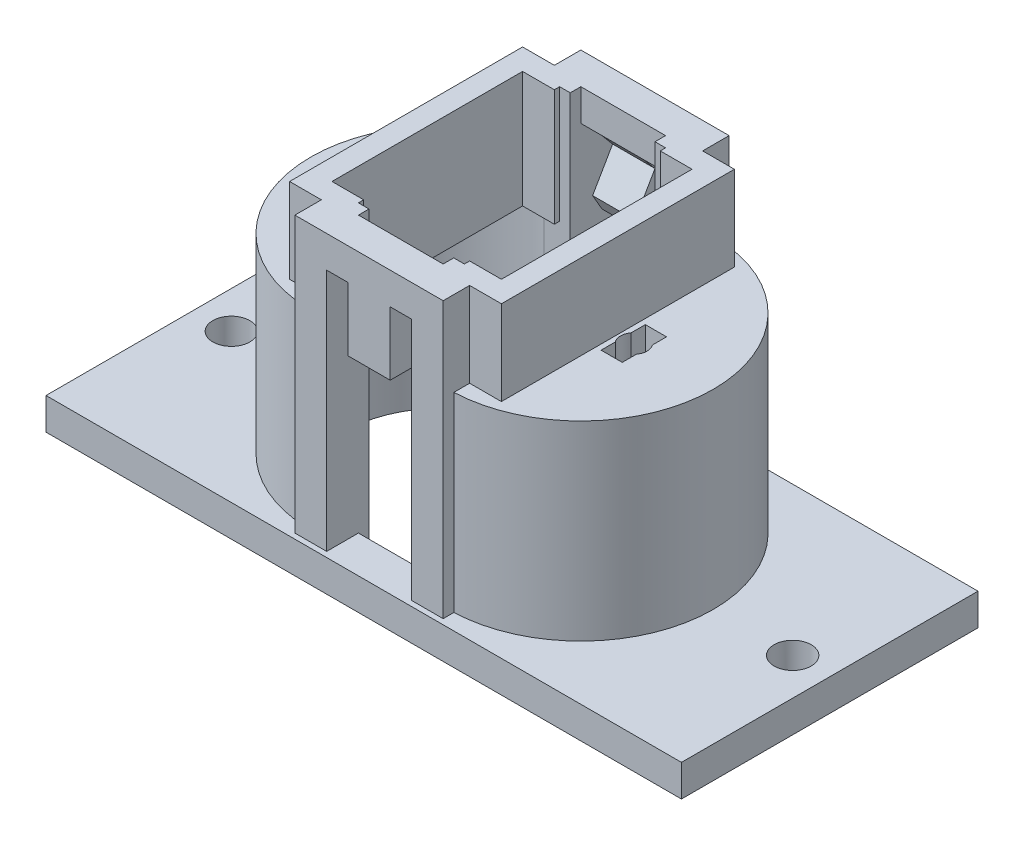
ISO-10303-21;
HEADER;
FILE_DESCRIPTION(('STEP AP214'),'2;1');
FILE_NAME('part.step','',(''),(''),'','','');
FILE_SCHEMA(('AUTOMOTIVE_DESIGN { 1 0 10303 214 1 1 1 1 }'));
ENDSEC;
DATA;
#1=APPLICATION_CONTEXT('core data for automotive mechanical design processes');
#2=APPLICATION_PROTOCOL_DEFINITION('international standard','automotive_design',2000,#1);
#3=PRODUCT_CONTEXT('',#1,'mechanical');
#4=PRODUCT('Part','Part','',(#3));
#5=PRODUCT_RELATED_PRODUCT_CATEGORY('part','',(#4));
#6=PRODUCT_DEFINITION_FORMATION('','',#4);
#7=PRODUCT_DEFINITION_CONTEXT('part definition',#1,'design');
#8=PRODUCT_DEFINITION('design','',#6,#7);
#9=PRODUCT_DEFINITION_SHAPE('','',#8);
#10=(LENGTH_UNIT() NAMED_UNIT(*) SI_UNIT(.MILLI.,.METRE.));
#11=(NAMED_UNIT(*) PLANE_ANGLE_UNIT() SI_UNIT($,.RADIAN.));
#12=(NAMED_UNIT(*) SI_UNIT($,.STERADIAN.) SOLID_ANGLE_UNIT());
#13=UNCERTAINTY_MEASURE_WITH_UNIT(LENGTH_MEASURE(1.E-05),#10,'distance_accuracy_value','');
#14=(GEOMETRIC_REPRESENTATION_CONTEXT(3) GLOBAL_UNCERTAINTY_ASSIGNED_CONTEXT((#13)) GLOBAL_UNIT_ASSIGNED_CONTEXT((#10,
#11,#12)) REPRESENTATION_CONTEXT('',''));
#15=CARTESIAN_POINT('',(0.,0.,0.));
#16=DIRECTION('',(0.,0.,1.));
#17=DIRECTION('',(1.,0.,0.));
#18=AXIS2_PLACEMENT_3D('',#15,#16,#17);
#19=CARTESIAN_POINT('',(0.,26.,0.));
#20=DIRECTION('',(0.,1.,0.));
#21=DIRECTION('',(0.,0.,1.));
#22=AXIS2_PLACEMENT_3D('',#19,#20,#21);
#23=PLANE('',#22);
#24=DIRECTION('',(0.,0.,1.));
#25=VECTOR('',#24,1.);
#26=CARTESIAN_POINT('',(-2.,26.,0.));
#27=LINE('',#26,#25);
#28=CARTESIAN_POINT('',(-2.,26.,-13.5));
#29=VERTEX_POINT('',#28);
#30=CARTESIAN_POINT('',(-2.,26.,-10.5));
#31=VERTEX_POINT('',#30);
#32=EDGE_CURVE('E1052',#29,#31,#27,.T.);
#33=ORIENTED_EDGE('',*,*,#32,.T.);
#34=DIRECTION('',(1.,0.,0.));
#35=VECTOR('',#34,1.);
#36=CARTESIAN_POINT('',(0.,26.,-10.5));
#37=LINE('',#36,#35);
#38=CARTESIAN_POINT('',(-4.,26.,-10.5));
#39=VERTEX_POINT('',#38);
#40=EDGE_CURVE('E1126',#39,#31,#37,.T.);
#41=ORIENTED_EDGE('',*,*,#40,.F.);
#42=DIRECTION('',(0.,0.,-1.));
#43=VECTOR('',#42,1.);
#44=CARTESIAN_POINT('',(-4.,26.,-13.5));
#45=LINE('',#44,#43);
#46=CARTESIAN_POINT('',(-4.,26.,-13.5));
#47=VERTEX_POINT('',#46);
#48=EDGE_CURVE('E580',#39,#47,#45,.T.);
#49=ORIENTED_EDGE('',*,*,#48,.T.);
#50=DIRECTION('',(-1.,0.,0.));
#51=VECTOR('',#50,1.);
#52=CARTESIAN_POINT('',(0.,26.,-13.5));
#53=LINE('',#52,#51);
#54=EDGE_CURVE('E1117',#29,#47,#53,.T.);
#55=ORIENTED_EDGE('',*,*,#54,.F.);
#56=EDGE_LOOP('',(#33,#41,#49,#55));
#57=FACE_BOUND('',#56,.T.);
#58=ADVANCED_FACE('F41',(#57),#23,.F.);
#59=DIRECTION('',(0.,0.,-1.));
#60=VECTOR('',#59,1.);
#61=CARTESIAN_POINT('',(-2.,26.,0.));
#62=LINE('',#61,#60);
#63=CARTESIAN_POINT('',(-2.,26.,13.5));
#64=VERTEX_POINT('',#63);
#65=CARTESIAN_POINT('',(-2.,26.,10.5));
#66=VERTEX_POINT('',#65);
#67=EDGE_CURVE('E1075',#64,#66,#62,.T.);
#68=ORIENTED_EDGE('',*,*,#67,.F.);
#69=DIRECTION('',(1.,0.,0.));
#70=VECTOR('',#69,1.);
#71=CARTESIAN_POINT('',(0.,26.,13.5));
#72=LINE('',#71,#70);
#73=CARTESIAN_POINT('',(-4.,26.,13.5));
#74=VERTEX_POINT('',#73);
#75=EDGE_CURVE('E1122',#74,#64,#72,.T.);
#76=ORIENTED_EDGE('',*,*,#75,.F.);
#77=DIRECTION('',(0.,0.,-1.));
#78=VECTOR('',#77,1.);
#79=CARTESIAN_POINT('',(-4.,26.,8.));
#80=LINE('',#79,#78);
#81=CARTESIAN_POINT('',(-4.,26.,10.5));
#82=VERTEX_POINT('',#81);
#83=EDGE_CURVE('E575',#74,#82,#80,.T.);
#84=ORIENTED_EDGE('',*,*,#83,.T.);
#85=DIRECTION('',(1.,0.,0.));
#86=VECTOR('',#85,1.);
#87=CARTESIAN_POINT('',(0.,26.,10.5));
#88=LINE('',#87,#86);
#89=EDGE_CURVE('E1130',#82,#66,#88,.T.);
#90=ORIENTED_EDGE('',*,*,#89,.T.);
#91=EDGE_LOOP('',(#68,#76,#84,#90));
#92=FACE_BOUND('',#91,.T.);
#93=ADVANCED_FACE('F1307',(#92),#23,.F.);
#94=CARTESIAN_POINT('',(0.,3.,0.));
#95=DIRECTION('',(0.,1.,0.));
#96=DIRECTION('',(0.,0.,1.));
#97=AXIS2_PLACEMENT_3D('',#94,#95,#96);
#98=PLANE('',#97);
#99=CARTESIAN_POINT('',(-26.5,3.,0.));
#100=DIRECTION('',(0.,1.,0.));
#101=DIRECTION('',(0.,0.,1.));
#102=AXIS2_PLACEMENT_3D('',#99,#100,#101);
#103=CIRCLE('',#102,1.75);
#104=CARTESIAN_POINT('',(-26.5,3.,1.75000000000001));
#105=VERTEX_POINT('',#104);
#106=EDGE_CURVE('E896',#105,#105,#103,.T.);
#107=ORIENTED_EDGE('',*,*,#106,.F.);
#108=EDGE_LOOP('',(#107));
#109=FACE_BOUND('',#108,.T.);
#110=CARTESIAN_POINT('',(26.5,3.,0.));
#111=DIRECTION('',(0.,1.,0.));
#112=DIRECTION('',(0.,0.,-1.));
#113=AXIS2_PLACEMENT_3D('',#110,#111,#112);
#114=CIRCLE('',#113,1.75);
#115=CARTESIAN_POINT('',(26.5,3.,-1.74999999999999));
#116=VERTEX_POINT('',#115);
#117=EDGE_CURVE('E901',#116,#116,#114,.T.);
#118=ORIENTED_EDGE('',*,*,#117,.F.);
#119=EDGE_LOOP('',(#118));
#120=FACE_BOUND('',#119,.T.);
#121=DIRECTION('',(1.,0.,0.));
#122=VECTOR('',#121,1.);
#123=CARTESIAN_POINT('',(0.,3.,14.));
#124=LINE('',#123,#122);
#125=CARTESIAN_POINT('',(-30.,3.,14.));
#126=VERTEX_POINT('',#125);
#127=CARTESIAN_POINT('',(30.,3.,14.));
#128=VERTEX_POINT('',#127);
#129=EDGE_CURVE('E805',#126,#128,#124,.T.);
#130=ORIENTED_EDGE('',*,*,#129,.T.);
#131=DIRECTION('',(0.,0.,-1.));
#132=VECTOR('',#131,1.);
#133=CARTESIAN_POINT('',(30.,3.,0.));
#134=LINE('',#133,#132);
#135=CARTESIAN_POINT('',(30.,3.,-14.));
#136=VERTEX_POINT('',#135);
#137=EDGE_CURVE('E808',#128,#136,#134,.T.);
#138=ORIENTED_EDGE('',*,*,#137,.T.);
#139=DIRECTION('',(1.,0.,0.));
#140=VECTOR('',#139,1.);
#141=CARTESIAN_POINT('',(0.,3.,-14.));
#142=LINE('',#141,#140);
#143=CARTESIAN_POINT('',(-30.,3.,-14.));
#144=VERTEX_POINT('',#143);
#145=EDGE_CURVE('E810',#144,#136,#142,.T.);
#146=ORIENTED_EDGE('',*,*,#145,.F.);
#147=DIRECTION('',(0.,0.,-1.));
#148=VECTOR('',#147,1.);
#149=CARTESIAN_POINT('',(-30.,3.,0.));
#150=LINE('',#149,#148);
#151=EDGE_CURVE('E813',#126,#144,#150,.T.);
#152=ORIENTED_EDGE('',*,*,#151,.F.);
#153=EDGE_LOOP('',(#130,#138,#146,#152));
#154=FACE_BOUND('',#153,.T.);
#155=DIRECTION('',(1.,0.,0.));
#156=VECTOR('',#155,1.);
#157=CARTESIAN_POINT('',(0.,3.,10.5));
#158=LINE('',#157,#156);
#159=CARTESIAN_POINT('',(-4.,3.,10.5));
#160=VERTEX_POINT('',#159);
#161=CARTESIAN_POINT('',(4.,3.,10.5));
#162=VERTEX_POINT('',#161);
#163=EDGE_CURVE('E799',#160,#162,#158,.T.);
#164=ORIENTED_EDGE('',*,*,#163,.F.);
#165=DIRECTION('',(0.,0.,-1.));
#166=VECTOR('',#165,1.);
#167=CARTESIAN_POINT('',(-3.99999999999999,3.,0.));
#168=LINE('',#167,#166);
#169=CARTESIAN_POINT('',(-4.,3.,13.5));
#170=VERTEX_POINT('',#169);
#171=EDGE_CURVE('E736',#170,#160,#168,.T.);
#172=ORIENTED_EDGE('',*,*,#171,.F.);
#173=DIRECTION('',(1.,0.,0.));
#174=VECTOR('',#173,1.);
#175=CARTESIAN_POINT('',(0.,3.,13.5));
#176=LINE('',#175,#174);
#177=CARTESIAN_POINT('',(-7.,3.,13.5));
#178=VERTEX_POINT('',#177);
#179=EDGE_CURVE('E733',#178,#170,#176,.T.);
#180=ORIENTED_EDGE('',*,*,#179,.F.);
#181=DIRECTION('',(0.,0.,-1.));
#182=VECTOR('',#181,1.);
#183=CARTESIAN_POINT('',(-7.00000000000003,3.,0.));
#184=LINE('',#183,#182);
#185=CARTESIAN_POINT('',(-7.,3.,12.4899959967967));
#186=VERTEX_POINT('',#185);
#187=EDGE_CURVE('E731',#178,#186,#184,.T.);
#188=ORIENTED_EDGE('',*,*,#187,.T.);
#189=CARTESIAN_POINT('',(-6.49999999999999,3.,0.));
#190=DIRECTION('',(0.,1.,0.));
#191=DIRECTION('',(0.,0.,1.));
#192=AXIS2_PLACEMENT_3D('',#189,#190,#191);
#193=CIRCLE('',#192,12.5);
#194=CARTESIAN_POINT('',(-7.,3.,-12.4899959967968));
#195=VERTEX_POINT('',#194);
#196=EDGE_CURVE('E728',#195,#186,#193,.T.);
#197=ORIENTED_EDGE('',*,*,#196,.F.);
#198=DIRECTION('',(0.,0.,1.));
#199=VECTOR('',#198,1.);
#200=CARTESIAN_POINT('',(-7.,3.,0.));
#201=LINE('',#200,#199);
#202=CARTESIAN_POINT('',(-7.,3.,-13.5));
#203=VERTEX_POINT('',#202);
#204=EDGE_CURVE('E715',#203,#195,#201,.T.);
#205=ORIENTED_EDGE('',*,*,#204,.F.);
#206=DIRECTION('',(1.,0.,0.));
#207=VECTOR('',#206,1.);
#208=CARTESIAN_POINT('',(0.,3.,-13.5));
#209=LINE('',#208,#207);
#210=CARTESIAN_POINT('',(-4.,3.,-13.5));
#211=VERTEX_POINT('',#210);
#212=EDGE_CURVE('E719',#203,#211,#209,.T.);
#213=ORIENTED_EDGE('',*,*,#212,.T.);
#214=DIRECTION('',(0.,0.,1.));
#215=VECTOR('',#214,1.);
#216=CARTESIAN_POINT('',(-4.00000000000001,3.,0.));
#217=LINE('',#216,#215);
#218=CARTESIAN_POINT('',(-4.,3.,-10.5));
#219=VERTEX_POINT('',#218);
#220=EDGE_CURVE('E588',#211,#219,#217,.T.);
#221=ORIENTED_EDGE('',*,*,#220,.T.);
#222=DIRECTION('',(1.,0.,0.));
#223=VECTOR('',#222,1.);
#224=CARTESIAN_POINT('',(0.,3.,-10.5));
#225=LINE('',#224,#223);
#226=CARTESIAN_POINT('',(4.,3.,-10.5));
#227=VERTEX_POINT('',#226);
#228=EDGE_CURVE('E802',#219,#227,#225,.T.);
#229=ORIENTED_EDGE('',*,*,#228,.T.);
#230=DIRECTION('',(0.,0.,1.));
#231=VECTOR('',#230,1.);
#232=CARTESIAN_POINT('',(3.99999999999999,3.,0.));
#233=LINE('',#232,#231);
#234=CARTESIAN_POINT('',(4.,3.,-13.5));
#235=VERTEX_POINT('',#234);
#236=EDGE_CURVE('E776',#235,#227,#233,.T.);
#237=ORIENTED_EDGE('',*,*,#236,.F.);
#238=DIRECTION('',(-1.,0.,0.));
#239=VECTOR('',#238,1.);
#240=CARTESIAN_POINT('',(0.,3.,-13.5));
#241=LINE('',#240,#239);
#242=CARTESIAN_POINT('',(7.,3.,-13.5));
#243=VERTEX_POINT('',#242);
#244=EDGE_CURVE('E773',#243,#235,#241,.T.);
#245=ORIENTED_EDGE('',*,*,#244,.F.);
#246=DIRECTION('',(0.,0.,1.));
#247=VECTOR('',#246,1.);
#248=CARTESIAN_POINT('',(6.99999999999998,3.,0.));
#249=LINE('',#248,#247);
#250=CARTESIAN_POINT('',(7.,3.,-12.4899959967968));
#251=VERTEX_POINT('',#250);
#252=EDGE_CURVE('E771',#243,#251,#249,.T.);
#253=ORIENTED_EDGE('',*,*,#252,.T.);
#254=CARTESIAN_POINT('',(6.49999999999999,3.,0.));
#255=DIRECTION('',(0.,1.,0.));
#256=DIRECTION('',(0.,0.,1.));
#257=AXIS2_PLACEMENT_3D('',#254,#255,#256);
#258=CIRCLE('',#257,12.5);
#259=CARTESIAN_POINT('',(7.,3.,12.4899959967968));
#260=VERTEX_POINT('',#259);
#261=EDGE_CURVE('E768',#260,#251,#258,.T.);
#262=ORIENTED_EDGE('',*,*,#261,.F.);
#263=DIRECTION('',(0.,0.,-1.));
#264=VECTOR('',#263,1.);
#265=CARTESIAN_POINT('',(7.00000000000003,3.,0.));
#266=LINE('',#265,#264);
#267=CARTESIAN_POINT('',(7.,3.,13.5));
#268=VERTEX_POINT('',#267);
#269=EDGE_CURVE('E755',#268,#260,#266,.T.);
#270=ORIENTED_EDGE('',*,*,#269,.F.);
#271=DIRECTION('',(-1.,0.,0.));
#272=VECTOR('',#271,1.);
#273=CARTESIAN_POINT('',(0.,3.,13.5));
#274=LINE('',#273,#272);
#275=CARTESIAN_POINT('',(4.00000000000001,3.,13.5));
#276=VERTEX_POINT('',#275);
#277=EDGE_CURVE('E759',#268,#276,#274,.T.);
#278=ORIENTED_EDGE('',*,*,#277,.T.);
#279=DIRECTION('',(0.,0.,1.));
#280=VECTOR('',#279,1.);
#281=CARTESIAN_POINT('',(4.,3.,0.));
#282=LINE('',#281,#280);
#283=EDGE_CURVE('E779',#162,#276,#282,.T.);
#284=ORIENTED_EDGE('',*,*,#283,.F.);
#285=EDGE_LOOP('',(#164,#172,#180,#188,#197,#205,#213,#221,#229,#237,#245,#253,#262,#270,#278,#284));
#286=FACE_BOUND('',#285,.T.);
#287=ADVANCED_FACE('F1160',(#109,#120,#154,#286),#98,.T.);
#288=CARTESIAN_POINT('',(0.,3.,14.));
#289=DIRECTION('',(0.,0.,-1.));
#290=DIRECTION('',(-1.,0.,0.));
#291=AXIS2_PLACEMENT_3D('',#288,#289,#290);
#292=PLANE('',#291);
#293=DIRECTION('',(1.,0.,0.));
#294=VECTOR('',#293,1.);
#295=CARTESIAN_POINT('',(0.,0.,14.));
#296=LINE('',#295,#294);
#297=CARTESIAN_POINT('',(-30.,0.,14.));
#298=VERTEX_POINT('',#297);
#299=CARTESIAN_POINT('',(30.,0.,14.));
#300=VERTEX_POINT('',#299);
#301=EDGE_CURVE('E851',#298,#300,#296,.T.);
#302=ORIENTED_EDGE('',*,*,#301,.T.);
#303=DIRECTION('',(0.,-1.,0.));
#304=VECTOR('',#303,1.);
#305=CARTESIAN_POINT('',(30.,3.,14.));
#306=LINE('',#305,#304);
#307=EDGE_CURVE('E782',#128,#300,#306,.T.);
#308=ORIENTED_EDGE('',*,*,#307,.F.);
#309=ORIENTED_EDGE('',*,*,#129,.F.);
#310=DIRECTION('',(0.,-1.,0.));
#311=VECTOR('',#310,1.);
#312=CARTESIAN_POINT('',(-30.,3.,14.));
#313=LINE('',#312,#311);
#314=EDGE_CURVE('E862',#126,#298,#313,.T.);
#315=ORIENTED_EDGE('',*,*,#314,.T.);
#316=EDGE_LOOP('',(#302,#308,#309,#315));
#317=FACE_BOUND('',#316,.T.);
#318=ADVANCED_FACE('F1419',(#317),#292,.F.);
#319=CARTESIAN_POINT('',(30.,3.,0.));
#320=DIRECTION('',(-1.,0.,0.));
#321=DIRECTION('',(0.,0.,1.));
#322=AXIS2_PLACEMENT_3D('',#319,#320,#321);
#323=PLANE('',#322);
#324=DIRECTION('',(0.,0.,-1.));
#325=VECTOR('',#324,1.);
#326=CARTESIAN_POINT('',(30.,0.,0.));
#327=LINE('',#326,#325);
#328=CARTESIAN_POINT('',(30.,0.,-14.));
#329=VERTEX_POINT('',#328);
#330=EDGE_CURVE('E854',#300,#329,#327,.T.);
#331=ORIENTED_EDGE('',*,*,#330,.T.);
#332=DIRECTION('',(0.,-1.,0.));
#333=VECTOR('',#332,1.);
#334=CARTESIAN_POINT('',(30.,3.,-14.));
#335=LINE('',#334,#333);
#336=EDGE_CURVE('E867',#136,#329,#335,.T.);
#337=ORIENTED_EDGE('',*,*,#336,.F.);
#338=ORIENTED_EDGE('',*,*,#137,.F.);
#339=ORIENTED_EDGE('',*,*,#307,.T.);
#340=EDGE_LOOP('',(#331,#337,#338,#339));
#341=FACE_BOUND('',#340,.T.);
#342=ADVANCED_FACE('F1432',(#341),#323,.F.);
#343=CARTESIAN_POINT('',(0.,3.,-14.));
#344=DIRECTION('',(0.,0.,-1.));
#345=DIRECTION('',(-1.,0.,0.));
#346=AXIS2_PLACEMENT_3D('',#343,#344,#345);
#347=PLANE('',#346);
#348=DIRECTION('',(1.,0.,0.));
#349=VECTOR('',#348,1.);
#350=CARTESIAN_POINT('',(0.,0.,-14.));
#351=LINE('',#350,#349);
#352=CARTESIAN_POINT('',(-30.,0.,-14.));
#353=VERTEX_POINT('',#352);
#354=EDGE_CURVE('E857',#353,#329,#351,.T.);
#355=ORIENTED_EDGE('',*,*,#354,.F.);
#356=DIRECTION('',(0.,-1.,0.));
#357=VECTOR('',#356,1.);
#358=CARTESIAN_POINT('',(-30.,3.,-14.));
#359=LINE('',#358,#357);
#360=EDGE_CURVE('E864',#144,#353,#359,.T.);
#361=ORIENTED_EDGE('',*,*,#360,.F.);
#362=ORIENTED_EDGE('',*,*,#145,.T.);
#363=ORIENTED_EDGE('',*,*,#336,.T.);
#364=EDGE_LOOP('',(#355,#361,#362,#363));
#365=FACE_BOUND('',#364,.T.);
#366=ADVANCED_FACE('F1429',(#365),#347,.T.);
#367=CARTESIAN_POINT('',(6.49999999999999,3.,0.));
#368=DIRECTION('',(0.,-1.,0.));
#369=DIRECTION('',(0.,0.,-1.));
#370=AXIS2_PLACEMENT_3D('',#367,#368,#369);
#371=CYLINDRICAL_SURFACE('',#370,9.49999999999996);
#372=CARTESIAN_POINT('',(6.49999999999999,0.,0.));
#373=DIRECTION('',(0.,1.,0.));
#374=DIRECTION('',(0.,0.,1.));
#375=AXIS2_PLACEMENT_3D('',#372,#373,#374);
#376=CIRCLE('',#375,9.49999999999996);
#377=CARTESIAN_POINT('',(6.49999999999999,0.,9.49999999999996));
#378=VERTEX_POINT('',#377);
#379=CARTESIAN_POINT('',(6.49999999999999,0.,-9.49999999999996));
#380=VERTEX_POINT('',#379);
#381=EDGE_CURVE('E798',#378,#380,#376,.T.);
#382=ORIENTED_EDGE('',*,*,#381,.F.);
#383=DIRECTION('',(0.,-1.,0.));
#384=VECTOR('',#383,1.);
#385=CARTESIAN_POINT('',(6.49999999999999,3.,9.49999999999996));
#386=LINE('',#385,#384);
#387=CARTESIAN_POINT('',(6.49999999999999,18.,9.49999999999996));
#388=VERTEX_POINT('',#387);
#389=EDGE_CURVE('E865',#388,#378,#386,.T.);
#390=ORIENTED_EDGE('',*,*,#389,.F.);
#391=CARTESIAN_POINT('',(6.49999999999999,18.,0.));
#392=DIRECTION('',(0.,1.,0.));
#393=DIRECTION('',(0.,0.,1.));
#394=AXIS2_PLACEMENT_3D('',#391,#392,#393);
#395=CIRCLE('',#394,9.49999999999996);
#396=CARTESIAN_POINT('',(6.49999999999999,18.,-9.49999999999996));
#397=VERTEX_POINT('',#396);
#398=EDGE_CURVE('E758',#397,#388,#395,.F.);
#399=ORIENTED_EDGE('',*,*,#398,.F.);
#400=DIRECTION('',(0.,-1.,0.));
#401=VECTOR('',#400,1.);
#402=CARTESIAN_POINT('',(6.49999999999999,3.,-9.49999999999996));
#403=LINE('',#402,#401);
#404=EDGE_CURVE('E816',#397,#380,#403,.T.);
#405=ORIENTED_EDGE('',*,*,#404,.T.);
#406=EDGE_LOOP('',(#382,#390,#399,#405));
#407=FACE_BOUND('',#406,.T.);
#408=ADVANCED_FACE('F43',(#407),#371,.F.);
#409=CARTESIAN_POINT('',(2.76861866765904E-13,3.,9.50000000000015));
#410=DIRECTION('',(0.,0.,-1.));
#411=DIRECTION('',(-1.,0.,0.));
#412=AXIS2_PLACEMENT_3D('',#409,#410,#411);
#413=PLANE('',#412);
#414=DIRECTION('',(-1.,0.,0.));
#415=VECTOR('',#414,1.);
#416=CARTESIAN_POINT('',(2.76861866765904E-13,29.,9.50000000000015));
#417=LINE('',#416,#415);
#418=CARTESIAN_POINT('',(5.00000000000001,29.,9.50000000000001));
#419=VERTEX_POINT('',#418);
#420=CARTESIAN_POINT('',(4.,29.,9.5));
#421=VERTEX_POINT('',#420);
#422=EDGE_CURVE('E950',#419,#421,#417,.T.);
#423=ORIENTED_EDGE('',*,*,#422,.F.);
#424=DIRECTION('',(0.,-1.,0.));
#425=VECTOR('',#424,1.);
#426=CARTESIAN_POINT('',(5.00000000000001,53.9164878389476,9.5));
#427=LINE('',#426,#425);
#428=CARTESIAN_POINT('',(5.00000000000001,18.,9.5));
#429=VERTEX_POINT('',#428);
#430=EDGE_CURVE('E993',#419,#429,#427,.T.);
#431=ORIENTED_EDGE('',*,*,#430,.T.);
#432=DIRECTION('',(-1.,0.,0.));
#433=VECTOR('',#432,1.);
#434=CARTESIAN_POINT('',(2.76861866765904E-13,18.,9.50000000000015));
#435=LINE('',#434,#433);
#436=EDGE_CURVE('E762',#388,#429,#435,.T.);
#437=ORIENTED_EDGE('',*,*,#436,.F.);
#438=ORIENTED_EDGE('',*,*,#389,.T.);
#439=DIRECTION('',(1.,0.,0.));
#440=VECTOR('',#439,1.);
#441=CARTESIAN_POINT('',(2.76861866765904E-13,0.,9.50000000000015));
#442=LINE('',#441,#440);
#443=CARTESIAN_POINT('',(4.,0.,9.50000000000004));
#444=VERTEX_POINT('',#443);
#445=EDGE_CURVE('E819',#444,#378,#442,.T.);
#446=ORIENTED_EDGE('',*,*,#445,.F.);
#447=DIRECTION('',(0.,-1.,0.));
#448=VECTOR('',#447,1.);
#449=CARTESIAN_POINT('',(4.,3.,9.50000000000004));
#450=LINE('',#449,#448);
#451=EDGE_CURVE('E891',#421,#444,#450,.T.);
#452=ORIENTED_EDGE('',*,*,#451,.F.);
#453=EDGE_LOOP('',(#423,#431,#437,#438,#446,#452));
#454=FACE_BOUND('',#453,.T.);
#455=ADVANCED_FACE('F1287',(#454),#413,.T.);
#456=CARTESIAN_POINT('',(4.,3.,0.));
#457=DIRECTION('',(-1.,0.,0.));
#458=DIRECTION('',(0.,0.,1.));
#459=AXIS2_PLACEMENT_3D('',#456,#457,#458);
#460=PLANE('',#459);
#461=DIRECTION('',(0.,0.,1.));
#462=VECTOR('',#461,1.);
#463=CARTESIAN_POINT('',(4.,29.,0.));
#464=LINE('',#463,#462);
#465=CARTESIAN_POINT('',(4.,29.,10.5));
#466=VERTEX_POINT('',#465);
#467=EDGE_CURVE('E948',#421,#466,#464,.T.);
#468=ORIENTED_EDGE('',*,*,#467,.F.);
#469=ORIENTED_EDGE('',*,*,#451,.T.);
#470=DIRECTION('',(0.,0.,-1.));
#471=VECTOR('',#470,1.);
#472=CARTESIAN_POINT('',(4.,0.,0.));
#473=LINE('',#472,#471);
#474=CARTESIAN_POINT('',(4.,0.,10.5));
#475=VERTEX_POINT('',#474);
#476=EDGE_CURVE('E822',#475,#444,#473,.T.);
#477=ORIENTED_EDGE('',*,*,#476,.F.);
#478=DIRECTION('',(0.,-1.,0.));
#479=VECTOR('',#478,1.);
#480=CARTESIAN_POINT('',(4.,3.,10.5));
#481=LINE('',#480,#479);
#482=EDGE_CURVE('E889',#162,#475,#481,.T.);
#483=ORIENTED_EDGE('',*,*,#482,.F.);
#484=ORIENTED_EDGE('',*,*,#283,.T.);
#485=DIRECTION('',(0.,-1.,0.));
#486=VECTOR('',#485,1.);
#487=CARTESIAN_POINT('',(4.00000000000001,18.,13.5));
#488=LINE('',#487,#486);
#489=CARTESIAN_POINT('',(4.00000000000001,26.,13.5));
#490=VERTEX_POINT('',#489);
#491=EDGE_CURVE('E785',#490,#276,#488,.T.);
#492=ORIENTED_EDGE('',*,*,#491,.F.);
#493=DIRECTION('',(0.,0.,1.));
#494=VECTOR('',#493,1.);
#495=CARTESIAN_POINT('',(4.00000000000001,26.,13.5));
#496=LINE('',#495,#494);
#497=CARTESIAN_POINT('',(4.00000000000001,26.,10.5));
#498=VERTEX_POINT('',#497);
#499=EDGE_CURVE('E560',#498,#490,#496,.T.);
#500=ORIENTED_EDGE('',*,*,#499,.F.);
#501=DIRECTION('',(0.,-1.,0.));
#502=VECTOR('',#501,1.);
#503=CARTESIAN_POINT('',(4.,34.5,10.5));
#504=LINE('',#503,#502);
#505=EDGE_CURVE('E1135',#466,#498,#504,.T.);
#506=ORIENTED_EDGE('',*,*,#505,.F.);
#507=EDGE_LOOP('',(#468,#469,#477,#483,#484,#492,#500,#506));
#508=FACE_BOUND('',#507,.T.);
#509=ADVANCED_FACE('F1271',(#508),#460,.T.);
#510=CARTESIAN_POINT('',(0.,3.,10.5));
#511=DIRECTION('',(0.,0.,-1.));
#512=DIRECTION('',(-1.,0.,0.));
#513=AXIS2_PLACEMENT_3D('',#510,#511,#512);
#514=PLANE('',#513);
#515=DIRECTION('',(1.,0.,0.));
#516=VECTOR('',#515,1.);
#517=CARTESIAN_POINT('',(0.,0.,10.5));
#518=LINE('',#517,#516);
#519=CARTESIAN_POINT('',(-4.,0.,10.5));
#520=VERTEX_POINT('',#519);
#521=EDGE_CURVE('E825',#520,#475,#518,.T.);
#522=ORIENTED_EDGE('',*,*,#521,.F.);
#523=DIRECTION('',(0.,-1.,0.));
#524=VECTOR('',#523,1.);
#525=CARTESIAN_POINT('',(-4.,3.,10.5));
#526=LINE('',#525,#524);
#527=EDGE_CURVE('E887',#160,#520,#526,.T.);
#528=ORIENTED_EDGE('',*,*,#527,.F.);
#529=ORIENTED_EDGE('',*,*,#163,.T.);
#530=ORIENTED_EDGE('',*,*,#482,.T.);
#531=EDGE_LOOP('',(#522,#528,#529,#530));
#532=FACE_BOUND('',#531,.T.);
#533=ADVANCED_FACE('F1296',(#532),#514,.T.);
#534=CARTESIAN_POINT('',(-3.99999999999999,3.,0.));
#535=DIRECTION('',(-1.,0.,0.));
#536=DIRECTION('',(0.,0.,1.));
#537=AXIS2_PLACEMENT_3D('',#534,#535,#536);
#538=PLANE('',#537);
#539=DIRECTION('',(0.,-1.,0.));
#540=VECTOR('',#539,1.);
#541=CARTESIAN_POINT('',(-4.,3.,9.50000000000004));
#542=LINE('',#541,#540);
#543=CARTESIAN_POINT('',(-4.,29.,9.50000000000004));
#544=VERTEX_POINT('',#543);
#545=CARTESIAN_POINT('',(-4.,0.,9.50000000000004));
#546=VERTEX_POINT('',#545);
#547=EDGE_CURVE('E885',#544,#546,#542,.T.);
#548=ORIENTED_EDGE('',*,*,#547,.F.);
#549=DIRECTION('',(0.,0.,1.));
#550=VECTOR('',#549,1.);
#551=CARTESIAN_POINT('',(-3.99999999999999,29.,0.));
#552=LINE('',#551,#550);
#553=CARTESIAN_POINT('',(-4.,29.,10.5));
#554=VERTEX_POINT('',#553);
#555=EDGE_CURVE('E941',#544,#554,#552,.T.);
#556=ORIENTED_EDGE('',*,*,#555,.T.);
#557=DIRECTION('',(0.,-1.,0.));
#558=VECTOR('',#557,1.);
#559=CARTESIAN_POINT('',(-4.,34.5,10.5));
#560=LINE('',#559,#558);
#561=EDGE_CURVE('E1133',#554,#82,#560,.T.);
#562=ORIENTED_EDGE('',*,*,#561,.T.);
#563=ORIENTED_EDGE('',*,*,#83,.F.);
#564=DIRECTION('',(0.,-1.,0.));
#565=VECTOR('',#564,1.);
#566=CARTESIAN_POINT('',(-4.,18.,13.5));
#567=LINE('',#566,#565);
#568=EDGE_CURVE('E744',#74,#170,#567,.T.);
#569=ORIENTED_EDGE('',*,*,#568,.T.);
#570=ORIENTED_EDGE('',*,*,#171,.T.);
#571=ORIENTED_EDGE('',*,*,#527,.T.);
#572=DIRECTION('',(0.,0.,-1.));
#573=VECTOR('',#572,1.);
#574=CARTESIAN_POINT('',(-3.99999999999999,0.,0.));
#575=LINE('',#574,#573);
#576=EDGE_CURVE('E828',#520,#546,#575,.T.);
#577=ORIENTED_EDGE('',*,*,#576,.T.);
#578=EDGE_LOOP('',(#548,#556,#562,#563,#569,#570,#571,#577));
#579=FACE_BOUND('',#578,.T.);
#580=ADVANCED_FACE('F1239',(#579),#538,.F.);
#581=CARTESIAN_POINT('',(-2.76861866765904E-13,3.,9.50000000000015));
#582=DIRECTION('',(0.,0.,-1.));
#583=DIRECTION('',(-1.,0.,0.));
#584=AXIS2_PLACEMENT_3D('',#581,#582,#583);
#585=PLANE('',#584);
#586=DIRECTION('',(-1.,0.,0.));
#587=VECTOR('',#586,1.);
#588=CARTESIAN_POINT('',(-2.76861866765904E-13,29.,9.50000000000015));
#589=LINE('',#588,#587);
#590=CARTESIAN_POINT('',(-5.,29.,9.50000000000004));
#591=VERTEX_POINT('',#590);
#592=EDGE_CURVE('E939',#544,#591,#589,.T.);
#593=ORIENTED_EDGE('',*,*,#592,.F.);
#594=ORIENTED_EDGE('',*,*,#547,.T.);
#595=DIRECTION('',(1.,0.,0.));
#596=VECTOR('',#595,1.);
#597=CARTESIAN_POINT('',(-2.76861866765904E-13,0.,9.50000000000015));
#598=LINE('',#597,#596);
#599=CARTESIAN_POINT('',(-6.49999999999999,0.,9.49999999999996));
#600=VERTEX_POINT('',#599);
#601=EDGE_CURVE('E831',#600,#546,#598,.T.);
#602=ORIENTED_EDGE('',*,*,#601,.F.);
#603=DIRECTION('',(0.,-1.,0.));
#604=VECTOR('',#603,1.);
#605=CARTESIAN_POINT('',(-6.49999999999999,3.,9.49999999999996));
#606=LINE('',#605,#604);
#607=CARTESIAN_POINT('',(-6.49999999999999,18.,9.49999999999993));
#608=VERTEX_POINT('',#607);
#609=EDGE_CURVE('E883',#608,#600,#606,.T.);
#610=ORIENTED_EDGE('',*,*,#609,.F.);
#611=DIRECTION('',(-1.,0.,0.));
#612=VECTOR('',#611,1.);
#613=CARTESIAN_POINT('',(-2.76861866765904E-13,18.,9.50000000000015));
#614=LINE('',#613,#612);
#615=CARTESIAN_POINT('',(-5.,18.,9.50000000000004));
#616=VERTEX_POINT('',#615);
#617=EDGE_CURVE('E716',#616,#608,#614,.T.);
#618=ORIENTED_EDGE('',*,*,#617,.F.);
#619=DIRECTION('',(0.,-1.,0.));
#620=VECTOR('',#619,1.);
#621=CARTESIAN_POINT('',(-5.,53.9164878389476,9.50000000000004));
#622=LINE('',#621,#620);
#623=EDGE_CURVE('E980',#591,#616,#622,.T.);
#624=ORIENTED_EDGE('',*,*,#623,.F.);
#625=EDGE_LOOP('',(#593,#594,#602,#610,#618,#624));
#626=FACE_BOUND('',#625,.T.);
#627=ADVANCED_FACE('F1303',(#626),#585,.T.);
#628=CARTESIAN_POINT('',(-6.49999999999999,3.,0.));
#629=DIRECTION('',(0.,-1.,0.));
#630=DIRECTION('',(0.,0.,-1.));
#631=AXIS2_PLACEMENT_3D('',#628,#629,#630);
#632=CYLINDRICAL_SURFACE('',#631,9.49999999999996);
#633=CARTESIAN_POINT('',(-6.49999999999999,0.,0.));
#634=DIRECTION('',(0.,1.,0.));
#635=DIRECTION('',(0.,0.,1.));
#636=AXIS2_PLACEMENT_3D('',#633,#634,#635);
#637=CIRCLE('',#636,9.49999999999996);
#638=CARTESIAN_POINT('',(-6.49999999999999,0.,-9.49999999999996));
#639=VERTEX_POINT('',#638);
#640=EDGE_CURVE('E834',#639,#600,#637,.T.);
#641=ORIENTED_EDGE('',*,*,#640,.F.);
#642=DIRECTION('',(0.,-1.,0.));
#643=VECTOR('',#642,1.);
#644=CARTESIAN_POINT('',(-6.49999999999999,3.,-9.49999999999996));
#645=LINE('',#644,#643);
#646=CARTESIAN_POINT('',(-6.49999999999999,18.,-9.49999999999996));
#647=VERTEX_POINT('',#646);
#648=EDGE_CURVE('E881',#647,#639,#645,.T.);
#649=ORIENTED_EDGE('',*,*,#648,.F.);
#650=CARTESIAN_POINT('',(-6.49999999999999,18.,0.));
#651=DIRECTION('',(0.,1.,0.));
#652=DIRECTION('',(0.,0.,1.));
#653=AXIS2_PLACEMENT_3D('',#650,#651,#652);
#654=CIRCLE('',#653,9.49999999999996);
#655=EDGE_CURVE('E718',#608,#647,#654,.F.);
#656=ORIENTED_EDGE('',*,*,#655,.F.);
#657=ORIENTED_EDGE('',*,*,#609,.T.);
#658=EDGE_LOOP('',(#641,#649,#656,#657));
#659=FACE_BOUND('',#658,.T.);
#660=ADVANCED_FACE('F1454',(#659),#632,.F.);
#661=CARTESIAN_POINT('',(-2.76861866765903E-13,3.,-9.50000000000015));
#662=DIRECTION('',(0.,0.,-1.));
#663=DIRECTION('',(-1.,0.,0.));
#664=AXIS2_PLACEMENT_3D('',#661,#662,#663);
#665=PLANE('',#664);
#666=DIRECTION('',(0.,-1.,0.));
#667=VECTOR('',#666,1.);
#668=CARTESIAN_POINT('',(-4.,3.,-9.50000000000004));
#669=LINE('',#668,#667);
#670=CARTESIAN_POINT('',(-4.,29.,-9.50000000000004));
#671=VERTEX_POINT('',#670);
#672=CARTESIAN_POINT('',(-4.,0.,-9.50000000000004));
#673=VERTEX_POINT('',#672);
#674=EDGE_CURVE('E879',#671,#673,#669,.T.);
#675=ORIENTED_EDGE('',*,*,#674,.F.);
#676=DIRECTION('',(-1.,0.,0.));
#677=VECTOR('',#676,1.);
#678=CARTESIAN_POINT('',(-2.76861866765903E-13,29.,-9.50000000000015));
#679=LINE('',#678,#677);
#680=CARTESIAN_POINT('',(-5.,29.,-9.5));
#681=VERTEX_POINT('',#680);
#682=EDGE_CURVE('E936',#671,#681,#679,.T.);
#683=ORIENTED_EDGE('',*,*,#682,.T.);
#684=DIRECTION('',(0.,-1.,0.));
#685=VECTOR('',#684,1.);
#686=CARTESIAN_POINT('',(-5.,53.9164878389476,-9.5));
#687=LINE('',#686,#685);
#688=CARTESIAN_POINT('',(-5.,18.,-9.5));
#689=VERTEX_POINT('',#688);
#690=EDGE_CURVE('E994',#681,#689,#687,.T.);
#691=ORIENTED_EDGE('',*,*,#690,.T.);
#692=DIRECTION('',(1.,0.,0.));
#693=VECTOR('',#692,1.);
#694=CARTESIAN_POINT('',(-2.76861866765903E-13,18.,-9.50000000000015));
#695=LINE('',#694,#693);
#696=EDGE_CURVE('E722',#647,#689,#695,.T.);
#697=ORIENTED_EDGE('',*,*,#696,.F.);
#698=ORIENTED_EDGE('',*,*,#648,.T.);
#699=DIRECTION('',(1.,0.,0.));
#700=VECTOR('',#699,1.);
#701=CARTESIAN_POINT('',(-2.76861866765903E-13,0.,-9.50000000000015));
#702=LINE('',#701,#700);
#703=EDGE_CURVE('E837',#639,#673,#702,.T.);
#704=ORIENTED_EDGE('',*,*,#703,.T.);
#705=EDGE_LOOP('',(#675,#683,#691,#697,#698,#704));
#706=FACE_BOUND('',#705,.T.);
#707=ADVANCED_FACE('F1451',(#706),#665,.F.);
#708=CARTESIAN_POINT('',(-4.00000000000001,3.,0.));
#709=DIRECTION('',(1.,0.,0.));
#710=DIRECTION('',(0.,0.,-1.));
#711=AXIS2_PLACEMENT_3D('',#708,#709,#710);
#712=PLANE('',#711);
#713=DIRECTION('',(0.,0.,-1.));
#714=VECTOR('',#713,1.);
#715=CARTESIAN_POINT('',(-4.00000000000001,29.,0.));
#716=LINE('',#715,#714);
#717=CARTESIAN_POINT('',(-4.,29.,-10.5));
#718=VERTEX_POINT('',#717);
#719=EDGE_CURVE('E946',#671,#718,#716,.T.);
#720=ORIENTED_EDGE('',*,*,#719,.F.);
#721=ORIENTED_EDGE('',*,*,#674,.T.);
#722=DIRECTION('',(0.,0.,1.));
#723=VECTOR('',#722,1.);
#724=CARTESIAN_POINT('',(-4.00000000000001,0.,0.));
#725=LINE('',#724,#723);
#726=CARTESIAN_POINT('',(-4.,0.,-10.5));
#727=VERTEX_POINT('',#726);
#728=EDGE_CURVE('E840',#727,#673,#725,.T.);
#729=ORIENTED_EDGE('',*,*,#728,.F.);
#730=DIRECTION('',(0.,-1.,0.));
#731=VECTOR('',#730,1.);
#732=CARTESIAN_POINT('',(-4.,3.,-10.5));
#733=LINE('',#732,#731);
#734=EDGE_CURVE('E877',#219,#727,#733,.T.);
#735=ORIENTED_EDGE('',*,*,#734,.F.);
#736=ORIENTED_EDGE('',*,*,#220,.F.);
#737=DIRECTION('',(0.,-1.,0.));
#738=VECTOR('',#737,1.);
#739=CARTESIAN_POINT('',(-4.,18.,-13.5));
#740=LINE('',#739,#738);
#741=EDGE_CURVE('E741',#47,#211,#740,.T.);
#742=ORIENTED_EDGE('',*,*,#741,.F.);
#743=ORIENTED_EDGE('',*,*,#48,.F.);
#744=DIRECTION('',(0.,-1.,0.));
#745=VECTOR('',#744,1.);
#746=CARTESIAN_POINT('',(-4.,34.5,-10.5));
#747=LINE('',#746,#745);
#748=EDGE_CURVE('E584',#718,#39,#747,.T.);
#749=ORIENTED_EDGE('',*,*,#748,.F.);
#750=EDGE_LOOP('',(#720,#721,#729,#735,#736,#742,#743,#749));
#751=FACE_BOUND('',#750,.T.);
#752=ADVANCED_FACE('F1197',(#751),#712,.T.);
#753=CARTESIAN_POINT('',(0.,3.,-10.5));
#754=DIRECTION('',(0.,0.,-1.));
#755=DIRECTION('',(-1.,0.,0.));
#756=AXIS2_PLACEMENT_3D('',#753,#754,#755);
#757=PLANE('',#756);
#758=DIRECTION('',(1.,0.,0.));
#759=VECTOR('',#758,1.);
#760=CARTESIAN_POINT('',(0.,0.,-10.5));
#761=LINE('',#760,#759);
#762=CARTESIAN_POINT('',(4.,0.,-10.5));
#763=VERTEX_POINT('',#762);
#764=EDGE_CURVE('E843',#727,#763,#761,.T.);
#765=ORIENTED_EDGE('',*,*,#764,.T.);
#766=DIRECTION('',(0.,-1.,0.));
#767=VECTOR('',#766,1.);
#768=CARTESIAN_POINT('',(4.,3.,-10.5));
#769=LINE('',#768,#767);
#770=EDGE_CURVE('E874',#227,#763,#769,.T.);
#771=ORIENTED_EDGE('',*,*,#770,.F.);
#772=ORIENTED_EDGE('',*,*,#228,.F.);
#773=ORIENTED_EDGE('',*,*,#734,.T.);
#774=EDGE_LOOP('',(#765,#771,#772,#773));
#775=FACE_BOUND('',#774,.T.);
#776=ADVANCED_FACE('F1445',(#775),#757,.F.);
#777=CARTESIAN_POINT('',(3.99999999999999,3.,0.));
#778=DIRECTION('',(1.,0.,0.));
#779=DIRECTION('',(0.,0.,-1.));
#780=AXIS2_PLACEMENT_3D('',#777,#778,#779);
#781=PLANE('',#780);
#782=DIRECTION('',(0.,-1.,0.));
#783=VECTOR('',#782,1.);
#784=CARTESIAN_POINT('',(4.,3.,-9.50000000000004));
#785=LINE('',#784,#783);
#786=CARTESIAN_POINT('',(4.,29.,-9.50000000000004));
#787=VERTEX_POINT('',#786);
#788=CARTESIAN_POINT('',(4.,0.,-9.50000000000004));
#789=VERTEX_POINT('',#788);
#790=EDGE_CURVE('E872',#787,#789,#785,.T.);
#791=ORIENTED_EDGE('',*,*,#790,.F.);
#792=DIRECTION('',(0.,0.,-1.));
#793=VECTOR('',#792,1.);
#794=CARTESIAN_POINT('',(3.99999999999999,29.,0.));
#795=LINE('',#794,#793);
#796=CARTESIAN_POINT('',(4.,29.,-10.5));
#797=VERTEX_POINT('',#796);
#798=EDGE_CURVE('E973',#787,#797,#795,.T.);
#799=ORIENTED_EDGE('',*,*,#798,.T.);
#800=DIRECTION('',(0.,-1.,0.));
#801=VECTOR('',#800,1.);
#802=CARTESIAN_POINT('',(4.,34.5,-10.5));
#803=LINE('',#802,#801);
#804=CARTESIAN_POINT('',(4.00000000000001,26.,-10.5));
#805=VERTEX_POINT('',#804);
#806=EDGE_CURVE('E1137',#797,#805,#803,.T.);
#807=ORIENTED_EDGE('',*,*,#806,.T.);
#808=DIRECTION('',(0.,0.,1.));
#809=VECTOR('',#808,1.);
#810=CARTESIAN_POINT('',(4.00000000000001,26.,-8.));
#811=LINE('',#810,#809);
#812=CARTESIAN_POINT('',(4.,26.,-13.5));
#813=VERTEX_POINT('',#812);
#814=EDGE_CURVE('E565',#813,#805,#811,.T.);
#815=ORIENTED_EDGE('',*,*,#814,.F.);
#816=DIRECTION('',(0.,-1.,0.));
#817=VECTOR('',#816,1.);
#818=CARTESIAN_POINT('',(4.,18.,-13.5));
#819=LINE('',#818,#817);
#820=EDGE_CURVE('E788',#813,#235,#819,.T.);
#821=ORIENTED_EDGE('',*,*,#820,.T.);
#822=ORIENTED_EDGE('',*,*,#236,.T.);
#823=ORIENTED_EDGE('',*,*,#770,.T.);
#824=DIRECTION('',(0.,0.,1.));
#825=VECTOR('',#824,1.);
#826=CARTESIAN_POINT('',(3.99999999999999,0.,0.));
#827=LINE('',#826,#825);
#828=EDGE_CURVE('E845',#763,#789,#827,.T.);
#829=ORIENTED_EDGE('',*,*,#828,.T.);
#830=EDGE_LOOP('',(#791,#799,#807,#815,#821,#822,#823,#829));
#831=FACE_BOUND('',#830,.T.);
#832=ADVANCED_FACE('F1169',(#831),#781,.F.);
#833=CARTESIAN_POINT('',(2.76861866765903E-13,3.,-9.50000000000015));
#834=DIRECTION('',(0.,0.,-1.));
#835=DIRECTION('',(-1.,0.,0.));
#836=AXIS2_PLACEMENT_3D('',#833,#834,#835);
#837=PLANE('',#836);
#838=DIRECTION('',(0.,-1.,0.));
#839=VECTOR('',#838,1.);
#840=CARTESIAN_POINT('',(5.00000000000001,53.9164878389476,-9.50000000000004));
#841=LINE('',#840,#839);
#842=CARTESIAN_POINT('',(5.00000000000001,29.,-9.50000000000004));
#843=VERTEX_POINT('',#842);
#844=CARTESIAN_POINT('',(5.00000000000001,18.,-9.50000000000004));
#845=VERTEX_POINT('',#844);
#846=EDGE_CURVE('E1009',#843,#845,#841,.T.);
#847=ORIENTED_EDGE('',*,*,#846,.F.);
#848=DIRECTION('',(-1.,0.,0.));
#849=VECTOR('',#848,1.);
#850=CARTESIAN_POINT('',(2.76861866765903E-13,29.,-9.50000000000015));
#851=LINE('',#850,#849);
#852=EDGE_CURVE('E970',#843,#787,#851,.T.);
#853=ORIENTED_EDGE('',*,*,#852,.T.);
#854=ORIENTED_EDGE('',*,*,#790,.T.);
#855=DIRECTION('',(1.,0.,0.));
#856=VECTOR('',#855,1.);
#857=CARTESIAN_POINT('',(2.76861866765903E-13,0.,-9.50000000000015));
#858=LINE('',#857,#856);
#859=EDGE_CURVE('E848',#789,#380,#858,.T.);
#860=ORIENTED_EDGE('',*,*,#859,.T.);
#861=ORIENTED_EDGE('',*,*,#404,.F.);
#862=DIRECTION('',(1.,0.,0.));
#863=VECTOR('',#862,1.);
#864=CARTESIAN_POINT('',(2.76861866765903E-13,18.,-9.50000000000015));
#865=LINE('',#864,#863);
#866=EDGE_CURVE('E756',#845,#397,#865,.T.);
#867=ORIENTED_EDGE('',*,*,#866,.F.);
#868=EDGE_LOOP('',(#847,#853,#854,#860,#861,#867));
#869=FACE_BOUND('',#868,.T.);
#870=ADVANCED_FACE('F1427',(#869),#837,.F.);
#871=CARTESIAN_POINT('',(-30.,3.,0.));
#872=DIRECTION('',(-1.,0.,0.));
#873=DIRECTION('',(0.,0.,1.));
#874=AXIS2_PLACEMENT_3D('',#871,#872,#873);
#875=PLANE('',#874);
#876=DIRECTION('',(0.,0.,-1.));
#877=VECTOR('',#876,1.);
#878=CARTESIAN_POINT('',(-30.,0.,0.));
#879=LINE('',#878,#877);
#880=EDGE_CURVE('E803',#298,#353,#879,.T.);
#881=ORIENTED_EDGE('',*,*,#880,.F.);
#882=ORIENTED_EDGE('',*,*,#314,.F.);
#883=ORIENTED_EDGE('',*,*,#151,.T.);
#884=ORIENTED_EDGE('',*,*,#360,.T.);
#885=EDGE_LOOP('',(#881,#882,#883,#884));
#886=FACE_BOUND('',#885,.T.);
#887=ADVANCED_FACE('F1423',(#886),#875,.T.);
#888=CARTESIAN_POINT('',(0.,0.,0.));
#889=DIRECTION('',(0.,1.,0.));
#890=DIRECTION('',(0.,0.,1.));
#891=AXIS2_PLACEMENT_3D('',#888,#889,#890);
#892=PLANE('',#891);
#893=CARTESIAN_POINT('',(-26.5,0.,0.));
#894=DIRECTION('',(0.,1.,0.));
#895=DIRECTION('',(0.,0.,1.));
#896=AXIS2_PLACEMENT_3D('',#893,#894,#895);
#897=CIRCLE('',#896,1.75);
#898=CARTESIAN_POINT('',(-26.5,0.,1.75000000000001));
#899=VERTEX_POINT('',#898);
#900=EDGE_CURVE('E45',#899,#899,#897,.T.);
#901=ORIENTED_EDGE('',*,*,#900,.T.);
#902=EDGE_LOOP('',(#901));
#903=FACE_BOUND('',#902,.T.);
#904=CARTESIAN_POINT('',(26.5,0.,0.));
#905=DIRECTION('',(0.,1.,0.));
#906=DIRECTION('',(0.,0.,1.));
#907=AXIS2_PLACEMENT_3D('',#904,#905,#906);
#908=CIRCLE('',#907,1.75);
#909=CARTESIAN_POINT('',(26.5,0.,1.75));
#910=VERTEX_POINT('',#909);
#911=EDGE_CURVE('E894',#910,#910,#908,.T.);
#912=ORIENTED_EDGE('',*,*,#911,.T.);
#913=EDGE_LOOP('',(#912));
#914=FACE_BOUND('',#913,.T.);
#915=ORIENTED_EDGE('',*,*,#381,.T.);
#916=ORIENTED_EDGE('',*,*,#859,.F.);
#917=ORIENTED_EDGE('',*,*,#828,.F.);
#918=ORIENTED_EDGE('',*,*,#764,.F.);
#919=ORIENTED_EDGE('',*,*,#728,.T.);
#920=ORIENTED_EDGE('',*,*,#703,.F.);
#921=ORIENTED_EDGE('',*,*,#640,.T.);
#922=ORIENTED_EDGE('',*,*,#601,.T.);
#923=ORIENTED_EDGE('',*,*,#576,.F.);
#924=ORIENTED_EDGE('',*,*,#521,.T.);
#925=ORIENTED_EDGE('',*,*,#476,.T.);
#926=ORIENTED_EDGE('',*,*,#445,.T.);
#927=EDGE_LOOP('',(#915,#916,#917,#918,#919,#920,#921,#922,#923,#924,#925,#926));
#928=FACE_BOUND('',#927,.T.);
#929=ORIENTED_EDGE('',*,*,#301,.F.);
#930=ORIENTED_EDGE('',*,*,#880,.T.);
#931=ORIENTED_EDGE('',*,*,#354,.T.);
#932=ORIENTED_EDGE('',*,*,#330,.F.);
#933=EDGE_LOOP('',(#929,#930,#931,#932));
#934=FACE_BOUND('',#933,.T.);
#935=ADVANCED_FACE('F1292',(#903,#914,#928,#934),#892,.F.);
#936=CARTESIAN_POINT('',(7.00000000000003,18.,0.));
#937=DIRECTION('',(-1.,0.,0.));
#938=DIRECTION('',(0.,0.,1.));
#939=AXIS2_PLACEMENT_3D('',#936,#937,#938);
#940=PLANE('',#939);
#941=DIRECTION('',(0.,-1.,0.));
#942=VECTOR('',#941,1.);
#943=CARTESIAN_POINT('',(6.99999999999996,26.,11.));
#944=LINE('',#943,#942);
#945=CARTESIAN_POINT('',(6.99999999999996,29.,11.));
#946=VERTEX_POINT('',#945);
#947=CARTESIAN_POINT('',(6.99999999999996,21.,11.));
#948=VERTEX_POINT('',#947);
#949=EDGE_CURVE('E572',#946,#948,#944,.T.);
#950=ORIENTED_EDGE('',*,*,#949,.F.);
#951=DIRECTION('',(0.,0.,-1.));
#952=VECTOR('',#951,1.);
#953=CARTESIAN_POINT('',(7.00000000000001,29.,13.5));
#954=LINE('',#953,#952);
#955=CARTESIAN_POINT('',(7.00000000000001,29.,13.5));
#956=VERTEX_POINT('',#955);
#957=EDGE_CURVE('E921',#956,#946,#954,.T.);
#958=ORIENTED_EDGE('',*,*,#957,.F.);
#959=DIRECTION('',(0.,-1.,0.));
#960=VECTOR('',#959,1.);
#961=CARTESIAN_POINT('',(7.,18.,13.5));
#962=LINE('',#961,#960);
#963=EDGE_CURVE('E765',#956,#268,#962,.T.);
#964=ORIENTED_EDGE('',*,*,#963,.T.);
#965=ORIENTED_EDGE('',*,*,#269,.T.);
#966=DIRECTION('',(0.,-1.,0.));
#967=VECTOR('',#966,1.);
#968=CARTESIAN_POINT('',(7.,18.,12.4899959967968));
#969=LINE('',#968,#967);
#970=CARTESIAN_POINT('',(7.,21.,12.4899959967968));
#971=VERTEX_POINT('',#970);
#972=EDGE_CURVE('E795',#971,#260,#969,.T.);
#973=ORIENTED_EDGE('',*,*,#972,.F.);
#974=DIRECTION('',(0.,0.,-1.));
#975=VECTOR('',#974,1.);
#976=CARTESIAN_POINT('',(7.00000000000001,21.,13.5));
#977=LINE('',#976,#975);
#978=EDGE_CURVE('E50',#971,#948,#977,.T.);
#979=ORIENTED_EDGE('',*,*,#978,.T.);
#980=EDGE_LOOP('',(#950,#958,#964,#965,#973,#979));
#981=FACE_BOUND('',#980,.T.);
#982=ADVANCED_FACE('F1413',(#981),#940,.F.);
#983=CARTESIAN_POINT('',(6.49999999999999,18.,0.));
#984=DIRECTION('',(0.,-1.,0.));
#985=DIRECTION('',(0.,0.,-1.));
#986=AXIS2_PLACEMENT_3D('',#983,#984,#985);
#987=CYLINDRICAL_SURFACE('',#986,12.5);
#988=ORIENTED_EDGE('',*,*,#261,.T.);
#989=DIRECTION('',(0.,-1.,0.));
#990=VECTOR('',#989,1.);
#991=CARTESIAN_POINT('',(7.,18.,-12.4899959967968));
#992=LINE('',#991,#990);
#993=CARTESIAN_POINT('',(7.,21.,-12.4899959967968));
#994=VERTEX_POINT('',#993);
#995=EDGE_CURVE('E792',#994,#251,#992,.T.);
#996=ORIENTED_EDGE('',*,*,#995,.F.);
#997=CARTESIAN_POINT('',(6.49999999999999,21.,0.));
#998=DIRECTION('',(0.,1.,0.));
#999=DIRECTION('',(0.,0.,1.));
#1000=AXIS2_PLACEMENT_3D('',#997,#998,#999);
#1001=CIRCLE('',#1000,12.5);
#1002=EDGE_CURVE('E607',#971,#994,#1001,.T.);
#1003=ORIENTED_EDGE('',*,*,#1002,.F.);
#1004=ORIENTED_EDGE('',*,*,#972,.T.);
#1005=EDGE_LOOP('',(#988,#996,#1003,#1004));
#1006=FACE_BOUND('',#1005,.T.);
#1007=ADVANCED_FACE('F1156',(#1006),#987,.T.);
#1008=CARTESIAN_POINT('',(6.99999999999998,18.,0.));
#1009=DIRECTION('',(1.,0.,0.));
#1010=DIRECTION('',(0.,0.,-1.));
#1011=AXIS2_PLACEMENT_3D('',#1008,#1009,#1010);
#1012=PLANE('',#1011);
#1013=DIRECTION('',(0.,0.,-1.));
#1014=VECTOR('',#1013,1.);
#1015=CARTESIAN_POINT('',(7.00000000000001,29.,-11.));
#1016=LINE('',#1015,#1014);
#1017=CARTESIAN_POINT('',(7.00000000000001,29.,-11.));
#1018=VERTEX_POINT('',#1017);
#1019=CARTESIAN_POINT('',(7.00000000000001,29.,-13.5));
#1020=VERTEX_POINT('',#1019);
#1021=EDGE_CURVE('E539',#1018,#1020,#1016,.T.);
#1022=ORIENTED_EDGE('',*,*,#1021,.F.);
#1023=DIRECTION('',(0.,-1.,0.));
#1024=VECTOR('',#1023,1.);
#1025=CARTESIAN_POINT('',(7.00000000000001,26.,-11.));
#1026=LINE('',#1025,#1024);
#1027=CARTESIAN_POINT('',(7.00000000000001,21.,-11.));
#1028=VERTEX_POINT('',#1027);
#1029=EDGE_CURVE('E549',#1018,#1028,#1026,.T.);
#1030=ORIENTED_EDGE('',*,*,#1029,.T.);
#1031=DIRECTION('',(0.,0.,-1.));
#1032=VECTOR('',#1031,1.);
#1033=CARTESIAN_POINT('',(7.00000000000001,21.,-11.));
#1034=LINE('',#1033,#1032);
#1035=EDGE_CURVE('E568',#1028,#994,#1034,.T.);
#1036=ORIENTED_EDGE('',*,*,#1035,.T.);
#1037=ORIENTED_EDGE('',*,*,#995,.T.);
#1038=ORIENTED_EDGE('',*,*,#252,.F.);
#1039=DIRECTION('',(0.,-1.,0.));
#1040=VECTOR('',#1039,1.);
#1041=CARTESIAN_POINT('',(7.,18.,-13.5));
#1042=LINE('',#1041,#1040);
#1043=EDGE_CURVE('E552',#1020,#243,#1042,.T.);
#1044=ORIENTED_EDGE('',*,*,#1043,.F.);
#1045=EDGE_LOOP('',(#1022,#1030,#1036,#1037,#1038,#1044));
#1046=FACE_BOUND('',#1045,.T.);
#1047=ADVANCED_FACE('F547',(#1046),#1012,.T.);
#1048=CARTESIAN_POINT('',(0.,18.,-13.5));
#1049=DIRECTION('',(0.,0.,1.));
#1050=DIRECTION('',(1.,0.,0.));
#1051=AXIS2_PLACEMENT_3D('',#1048,#1049,#1050);
#1052=PLANE('',#1051);
#1053=DIRECTION('',(0.,-1.,0.));
#1054=VECTOR('',#1053,1.);
#1055=CARTESIAN_POINT('',(-7.,18.,-13.5));
#1056=LINE('',#1055,#1054);
#1057=CARTESIAN_POINT('',(-7.,29.,-13.5));
#1058=VERTEX_POINT('',#1057);
#1059=EDGE_CURVE('E725',#1058,#203,#1056,.T.);
#1060=ORIENTED_EDGE('',*,*,#1059,.F.);
#1061=DIRECTION('',(-1.,0.,0.));
#1062=VECTOR('',#1061,1.);
#1063=CARTESIAN_POINT('',(7.00000000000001,29.,-13.5));
#1064=LINE('',#1063,#1062);
#1065=EDGE_CURVE('E553',#1020,#1058,#1064,.T.);
#1066=ORIENTED_EDGE('',*,*,#1065,.F.);
#1067=ORIENTED_EDGE('',*,*,#1043,.T.);
#1068=ORIENTED_EDGE('',*,*,#244,.T.);
#1069=ORIENTED_EDGE('',*,*,#820,.F.);
#1070=CARTESIAN_POINT('',(2.,26.,-13.5));
#1071=VERTEX_POINT('',#1070);
#1072=EDGE_CURVE('E1118',#813,#1071,#53,.T.);
#1073=ORIENTED_EDGE('',*,*,#1072,.T.);
#1074=DIRECTION('',(0.,-1.,0.));
#1075=VECTOR('',#1074,1.);
#1076=CARTESIAN_POINT('',(2.,0.,-13.5));
#1077=LINE('',#1076,#1075);
#1078=CARTESIAN_POINT('',(2.,20.,-13.5));
#1079=VERTEX_POINT('',#1078);
#1080=EDGE_CURVE('E1031',#1071,#1079,#1077,.T.);
#1081=ORIENTED_EDGE('',*,*,#1080,.T.);
#1082=DIRECTION('',(-1.,0.,0.));
#1083=VECTOR('',#1082,1.);
#1084=CARTESIAN_POINT('',(2.,20.,-13.5));
#1085=LINE('',#1084,#1083);
#1086=CARTESIAN_POINT('',(-2.,20.,-13.5));
#1087=VERTEX_POINT('',#1086);
#1088=EDGE_CURVE('E1049',#1079,#1087,#1085,.T.);
#1089=ORIENTED_EDGE('',*,*,#1088,.T.);
#1090=DIRECTION('',(0.,-1.,0.));
#1091=VECTOR('',#1090,1.);
#1092=CARTESIAN_POINT('',(-2.,0.,-13.5));
#1093=LINE('',#1092,#1091);
#1094=EDGE_CURVE('E996',#29,#1087,#1093,.T.);
#1095=ORIENTED_EDGE('',*,*,#1094,.F.);
#1096=ORIENTED_EDGE('',*,*,#54,.T.);
#1097=ORIENTED_EDGE('',*,*,#741,.T.);
#1098=ORIENTED_EDGE('',*,*,#212,.F.);
#1099=EDGE_LOOP('',(#1060,#1066,#1067,#1068,#1069,#1073,#1081,#1089,#1095,#1096,#1097,#1098));
#1100=FACE_BOUND('',#1099,.T.);
#1101=ADVANCED_FACE('F1165',(#1100),#1052,.F.);
#1102=CARTESIAN_POINT('',(0.,18.,13.5));
#1103=DIRECTION('',(0.,0.,1.));
#1104=DIRECTION('',(1.,0.,0.));
#1105=AXIS2_PLACEMENT_3D('',#1102,#1103,#1104);
#1106=PLANE('',#1105);
#1107=DIRECTION('',(1.,0.,0.));
#1108=VECTOR('',#1107,1.);
#1109=CARTESIAN_POINT('',(-7.,29.,13.5));
#1110=LINE('',#1109,#1108);
#1111=CARTESIAN_POINT('',(-7.,29.,13.5));
#1112=VERTEX_POINT('',#1111);
#1113=EDGE_CURVE('E919',#1112,#956,#1110,.T.);
#1114=ORIENTED_EDGE('',*,*,#1113,.F.);
#1115=DIRECTION('',(0.,-1.,0.));
#1116=VECTOR('',#1115,1.);
#1117=CARTESIAN_POINT('',(-7.,18.,13.5));
#1118=LINE('',#1117,#1116);
#1119=EDGE_CURVE('E747',#1112,#178,#1118,.T.);
#1120=ORIENTED_EDGE('',*,*,#1119,.T.);
#1121=ORIENTED_EDGE('',*,*,#179,.T.);
#1122=ORIENTED_EDGE('',*,*,#568,.F.);
#1123=ORIENTED_EDGE('',*,*,#75,.T.);
#1124=DIRECTION('',(0.,-1.,0.));
#1125=VECTOR('',#1124,1.);
#1126=CARTESIAN_POINT('',(-2.,0.,13.5));
#1127=LINE('',#1126,#1125);
#1128=CARTESIAN_POINT('',(-2.,20.,13.5));
#1129=VERTEX_POINT('',#1128);
#1130=EDGE_CURVE('E1094',#64,#1129,#1127,.T.);
#1131=ORIENTED_EDGE('',*,*,#1130,.T.);
#1132=DIRECTION('',(-1.,0.,0.));
#1133=VECTOR('',#1132,1.);
#1134=CARTESIAN_POINT('',(2.,20.,13.5));
#1135=LINE('',#1134,#1133);
#1136=CARTESIAN_POINT('',(2.,20.,13.5));
#1137=VERTEX_POINT('',#1136);
#1138=EDGE_CURVE('E1114',#1137,#1129,#1135,.T.);
#1139=ORIENTED_EDGE('',*,*,#1138,.F.);
#1140=DIRECTION('',(0.,-1.,0.));
#1141=VECTOR('',#1140,1.);
#1142=CARTESIAN_POINT('',(2.,0.,13.5));
#1143=LINE('',#1142,#1141);
#1144=CARTESIAN_POINT('',(2.,26.,13.5));
#1145=VERTEX_POINT('',#1144);
#1146=EDGE_CURVE('E1079',#1145,#1137,#1143,.T.);
#1147=ORIENTED_EDGE('',*,*,#1146,.F.);
#1148=EDGE_CURVE('E1121',#1145,#490,#72,.T.);
#1149=ORIENTED_EDGE('',*,*,#1148,.T.);
#1150=ORIENTED_EDGE('',*,*,#491,.T.);
#1151=ORIENTED_EDGE('',*,*,#277,.F.);
#1152=ORIENTED_EDGE('',*,*,#963,.F.);
#1153=EDGE_LOOP('',(#1114,#1120,#1121,#1122,#1123,#1131,#1139,#1147,#1149,#1150,#1151,#1152));
#1154=FACE_BOUND('',#1153,.T.);
#1155=ADVANCED_FACE('F1235',(#1154),#1106,.T.);
#1156=CARTESIAN_POINT('',(-7.,18.,0.));
#1157=DIRECTION('',(1.,0.,0.));
#1158=DIRECTION('',(0.,0.,-1.));
#1159=AXIS2_PLACEMENT_3D('',#1156,#1157,#1158);
#1160=PLANE('',#1159);
#1161=DIRECTION('',(0.,-1.,0.));
#1162=VECTOR('',#1161,1.);
#1163=CARTESIAN_POINT('',(-7.,26.,-11.));
#1164=LINE('',#1163,#1162);
#1165=CARTESIAN_POINT('',(-7.,29.,-11.));
#1166=VERTEX_POINT('',#1165);
#1167=CARTESIAN_POINT('',(-7.,21.,-11.));
#1168=VERTEX_POINT('',#1167);
#1169=EDGE_CURVE('E604',#1166,#1168,#1164,.T.);
#1170=ORIENTED_EDGE('',*,*,#1169,.F.);
#1171=DIRECTION('',(0.,0.,1.));
#1172=VECTOR('',#1171,1.);
#1173=CARTESIAN_POINT('',(-7.,29.,-13.5));
#1174=LINE('',#1173,#1172);
#1175=EDGE_CURVE('E909',#1058,#1166,#1174,.T.);
#1176=ORIENTED_EDGE('',*,*,#1175,.F.);
#1177=ORIENTED_EDGE('',*,*,#1059,.T.);
#1178=ORIENTED_EDGE('',*,*,#204,.T.);
#1179=DIRECTION('',(0.,-1.,0.));
#1180=VECTOR('',#1179,1.);
#1181=CARTESIAN_POINT('',(-7.,18.,-12.4899959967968));
#1182=LINE('',#1181,#1180);
#1183=CARTESIAN_POINT('',(-7.,21.,-12.4899959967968));
#1184=VERTEX_POINT('',#1183);
#1185=EDGE_CURVE('E752',#1184,#195,#1182,.T.);
#1186=ORIENTED_EDGE('',*,*,#1185,.F.);
#1187=DIRECTION('',(0.,0.,1.));
#1188=VECTOR('',#1187,1.);
#1189=CARTESIAN_POINT('',(-7.,21.,-13.5));
#1190=LINE('',#1189,#1188);
#1191=EDGE_CURVE('E585',#1184,#1168,#1190,.T.);
#1192=ORIENTED_EDGE('',*,*,#1191,.T.);
#1193=EDGE_LOOP('',(#1170,#1176,#1177,#1178,#1186,#1192));
#1194=FACE_BOUND('',#1193,.T.);
#1195=ADVANCED_FACE('F1205',(#1194),#1160,.F.);
#1196=CARTESIAN_POINT('',(-6.49999999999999,18.,0.));
#1197=DIRECTION('',(0.,-1.,0.));
#1198=DIRECTION('',(0.,0.,-1.));
#1199=AXIS2_PLACEMENT_3D('',#1196,#1197,#1198);
#1200=CYLINDRICAL_SURFACE('',#1199,12.5);
#1201=ORIENTED_EDGE('',*,*,#196,.T.);
#1202=DIRECTION('',(0.,-1.,0.));
#1203=VECTOR('',#1202,1.);
#1204=CARTESIAN_POINT('',(-7.,18.,12.4899959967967));
#1205=LINE('',#1204,#1203);
#1206=CARTESIAN_POINT('',(-7.,21.,12.4899959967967));
#1207=VERTEX_POINT('',#1206);
#1208=EDGE_CURVE('E749',#1207,#186,#1205,.T.);
#1209=ORIENTED_EDGE('',*,*,#1208,.F.);
#1210=CARTESIAN_POINT('',(-6.49999999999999,21.,0.));
#1211=DIRECTION('',(0.,1.,0.));
#1212=DIRECTION('',(0.,0.,1.));
#1213=AXIS2_PLACEMENT_3D('',#1210,#1211,#1212);
#1214=CIRCLE('',#1213,12.5);
#1215=EDGE_CURVE('E679',#1184,#1207,#1214,.T.);
#1216=ORIENTED_EDGE('',*,*,#1215,.F.);
#1217=ORIENTED_EDGE('',*,*,#1185,.T.);
#1218=EDGE_LOOP('',(#1201,#1209,#1216,#1217));
#1219=FACE_BOUND('',#1218,.T.);
#1220=ADVANCED_FACE('F1399',(#1219),#1200,.T.);
#1221=CARTESIAN_POINT('',(-7.00000000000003,18.,0.));
#1222=DIRECTION('',(-1.,0.,0.));
#1223=DIRECTION('',(0.,0.,1.));
#1224=AXIS2_PLACEMENT_3D('',#1221,#1222,#1223);
#1225=PLANE('',#1224);
#1226=DIRECTION('',(0.,0.,1.));
#1227=VECTOR('',#1226,1.);
#1228=CARTESIAN_POINT('',(-7.00000000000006,29.,11.));
#1229=LINE('',#1228,#1227);
#1230=CARTESIAN_POINT('',(-7.00000000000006,29.,11.));
#1231=VERTEX_POINT('',#1230);
#1232=EDGE_CURVE('E917',#1231,#1112,#1229,.T.);
#1233=ORIENTED_EDGE('',*,*,#1232,.F.);
#1234=DIRECTION('',(0.,-1.,0.));
#1235=VECTOR('',#1234,1.);
#1236=CARTESIAN_POINT('',(-7.00000000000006,26.,11.));
#1237=LINE('',#1236,#1235);
#1238=CARTESIAN_POINT('',(-7.00000000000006,21.,11.));
#1239=VERTEX_POINT('',#1238);
#1240=EDGE_CURVE('E578',#1231,#1239,#1237,.T.);
#1241=ORIENTED_EDGE('',*,*,#1240,.T.);
#1242=DIRECTION('',(0.,0.,1.));
#1243=VECTOR('',#1242,1.);
#1244=CARTESIAN_POINT('',(-7.00000000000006,21.,11.));
#1245=LINE('',#1244,#1243);
#1246=EDGE_CURVE('E579',#1239,#1207,#1245,.T.);
#1247=ORIENTED_EDGE('',*,*,#1246,.T.);
#1248=ORIENTED_EDGE('',*,*,#1208,.T.);
#1249=ORIENTED_EDGE('',*,*,#187,.F.);
#1250=ORIENTED_EDGE('',*,*,#1119,.F.);
#1251=EDGE_LOOP('',(#1233,#1241,#1247,#1248,#1249,#1250));
#1252=FACE_BOUND('',#1251,.T.);
#1253=ADVANCED_FACE('F1231',(#1252),#1225,.T.);
#1254=CARTESIAN_POINT('',(0.,18.,0.));
#1255=DIRECTION('',(0.,1.,0.));
#1256=DIRECTION('',(0.,0.,1.));
#1257=AXIS2_PLACEMENT_3D('',#1254,#1255,#1256);
#1258=PLANE('',#1257);
#1259=CARTESIAN_POINT('',(-11.5,18.,0.));
#1260=DIRECTION('',(0.,1.,0.));
#1261=DIRECTION('',(0.,0.,1.));
#1262=AXIS2_PLACEMENT_3D('',#1259,#1260,#1261);
#1263=CIRCLE('',#1262,1.25);
#1264=CARTESIAN_POINT('',(-10.5,18.,0.75));
#1265=VERTEX_POINT('',#1264);
#1266=CARTESIAN_POINT('',(-10.5,18.,-0.75));
#1267=VERTEX_POINT('',#1266);
#1268=EDGE_CURVE('E661',#1265,#1267,#1263,.T.);
#1269=ORIENTED_EDGE('',*,*,#1268,.T.);
#1270=DIRECTION('',(0.,0.,-1.));
#1271=VECTOR('',#1270,1.);
#1272=CARTESIAN_POINT('',(-10.5,18.,0.));
#1273=LINE('',#1272,#1271);
#1274=CARTESIAN_POINT('',(-10.5,18.,-2.09));
#1275=VERTEX_POINT('',#1274);
#1276=EDGE_CURVE('E666',#1267,#1275,#1273,.T.);
#1277=ORIENTED_EDGE('',*,*,#1276,.T.);
#1278=DIRECTION('',(1.,0.,0.));
#1279=VECTOR('',#1278,1.);
#1280=CARTESIAN_POINT('',(0.,18.,-2.09));
#1281=LINE('',#1280,#1279);
#1282=CARTESIAN_POINT('',(-12.5,18.,-2.09));
#1283=VERTEX_POINT('',#1282);
#1284=EDGE_CURVE('E696',#1283,#1275,#1281,.T.);
#1285=ORIENTED_EDGE('',*,*,#1284,.F.);
#1286=DIRECTION('',(0.,0.,-1.));
#1287=VECTOR('',#1286,1.);
#1288=CARTESIAN_POINT('',(-12.5,18.,0.));
#1289=LINE('',#1288,#1287);
#1290=CARTESIAN_POINT('',(-12.5,18.,-0.749999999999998));
#1291=VERTEX_POINT('',#1290);
#1292=EDGE_CURVE('E695',#1291,#1283,#1289,.T.);
#1293=ORIENTED_EDGE('',*,*,#1292,.F.);
#1294=CARTESIAN_POINT('',(-12.5,18.,0.749999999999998));
#1295=VERTEX_POINT('',#1294);
#1296=EDGE_CURVE('E686',#1291,#1295,#1263,.T.);
#1297=ORIENTED_EDGE('',*,*,#1296,.T.);
#1298=CARTESIAN_POINT('',(-12.5,18.,2.09));
#1299=VERTEX_POINT('',#1298);
#1300=EDGE_CURVE('E692',#1299,#1295,#1289,.T.);
#1301=ORIENTED_EDGE('',*,*,#1300,.F.);
#1302=DIRECTION('',(1.,0.,0.));
#1303=VECTOR('',#1302,1.);
#1304=CARTESIAN_POINT('',(0.,18.,2.09));
#1305=LINE('',#1304,#1303);
#1306=CARTESIAN_POINT('',(-10.5,18.,2.09));
#1307=VERTEX_POINT('',#1306);
#1308=EDGE_CURVE('E689',#1299,#1307,#1305,.T.);
#1309=ORIENTED_EDGE('',*,*,#1308,.T.);
#1310=EDGE_CURVE('E685',#1307,#1265,#1273,.T.);
#1311=ORIENTED_EDGE('',*,*,#1310,.T.);
#1312=EDGE_LOOP('',(#1269,#1277,#1285,#1293,#1297,#1301,#1309,#1311));
#1313=FACE_BOUND('',#1312,.T.);
#1314=DIRECTION('',(-1.,0.,0.));
#1315=VECTOR('',#1314,1.);
#1316=CARTESIAN_POINT('',(-5.,18.,9.00000000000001));
#1317=LINE('',#1316,#1315);
#1318=CARTESIAN_POINT('',(-5.,18.,9.00000000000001));
#1319=VERTEX_POINT('',#1318);
#1320=CARTESIAN_POINT('',(-8.,18.,9.00000000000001));
#1321=VERTEX_POINT('',#1320);
#1322=EDGE_CURVE('E987',#1319,#1321,#1317,.T.);
#1323=ORIENTED_EDGE('',*,*,#1322,.F.);
#1324=DIRECTION('',(0.,0.,-1.));
#1325=VECTOR('',#1324,1.);
#1326=CARTESIAN_POINT('',(-5.,18.,9.00000000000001));
#1327=LINE('',#1326,#1325);
#1328=EDGE_CURVE('E990',#616,#1319,#1327,.T.);
#1329=ORIENTED_EDGE('',*,*,#1328,.F.);
#1330=ORIENTED_EDGE('',*,*,#617,.T.);
#1331=ORIENTED_EDGE('',*,*,#655,.T.);
#1332=ORIENTED_EDGE('',*,*,#696,.T.);
#1333=DIRECTION('',(0.,0.,-1.));
#1334=VECTOR('',#1333,1.);
#1335=CARTESIAN_POINT('',(-5.,18.,-9.5));
#1336=LINE('',#1335,#1334);
#1337=CARTESIAN_POINT('',(-5.,18.,-9.));
#1338=VERTEX_POINT('',#1337);
#1339=EDGE_CURVE('E977',#1338,#689,#1336,.T.);
#1340=ORIENTED_EDGE('',*,*,#1339,.F.);
#1341=DIRECTION('',(1.,0.,0.));
#1342=VECTOR('',#1341,1.);
#1343=CARTESIAN_POINT('',(-5.,18.,-9.));
#1344=LINE('',#1343,#1342);
#1345=CARTESIAN_POINT('',(-8.,18.,-9.));
#1346=VERTEX_POINT('',#1345);
#1347=EDGE_CURVE('E981',#1346,#1338,#1344,.T.);
#1348=ORIENTED_EDGE('',*,*,#1347,.F.);
#1349=DIRECTION('',(0.,0.,-1.));
#1350=VECTOR('',#1349,1.);
#1351=CARTESIAN_POINT('',(-8.,18.,9.00000000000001));
#1352=LINE('',#1351,#1350);
#1353=EDGE_CURVE('E984',#1321,#1346,#1352,.T.);
#1354=ORIENTED_EDGE('',*,*,#1353,.F.);
#1355=EDGE_LOOP('',(#1323,#1329,#1330,#1331,#1332,#1340,#1348,#1354));
#1356=FACE_BOUND('',#1355,.T.);
#1357=ADVANCED_FACE('F1371',(#1313,#1356),#1258,.F.);
#1358=CARTESIAN_POINT('',(-11.5,21.,0.));
#1359=DIRECTION('',(0.,-1.,0.));
#1360=DIRECTION('',(0.,0.,-1.));
#1361=AXIS2_PLACEMENT_3D('',#1358,#1359,#1360);
#1362=CYLINDRICAL_SURFACE('',#1361,1.25);
#1363=ORIENTED_EDGE('',*,*,#1268,.F.);
#1364=DIRECTION('',(0.,-1.,0.));
#1365=VECTOR('',#1364,1.);
#1366=CARTESIAN_POINT('',(-10.5,21.,0.75));
#1367=LINE('',#1366,#1365);
#1368=CARTESIAN_POINT('',(-10.5,21.,0.75));
#1369=VERTEX_POINT('',#1368);
#1370=EDGE_CURVE('E713',#1369,#1265,#1367,.T.);
#1371=ORIENTED_EDGE('',*,*,#1370,.F.);
#1372=CARTESIAN_POINT('',(-11.5,21.,0.));
#1373=DIRECTION('',(0.,1.,0.));
#1374=DIRECTION('',(0.,0.,1.));
#1375=AXIS2_PLACEMENT_3D('',#1372,#1373,#1374);
#1376=CIRCLE('',#1375,1.25);
#1377=CARTESIAN_POINT('',(-10.5,21.,-0.75));
#1378=VERTEX_POINT('',#1377);
#1379=EDGE_CURVE('E662',#1369,#1378,#1376,.T.);
#1380=ORIENTED_EDGE('',*,*,#1379,.T.);
#1381=DIRECTION('',(0.,-1.,0.));
#1382=VECTOR('',#1381,1.);
#1383=CARTESIAN_POINT('',(-10.5,21.,-0.75));
#1384=LINE('',#1383,#1382);
#1385=EDGE_CURVE('E682',#1378,#1267,#1384,.T.);
#1386=ORIENTED_EDGE('',*,*,#1385,.T.);
#1387=EDGE_LOOP('',(#1363,#1371,#1380,#1386));
#1388=FACE_BOUND('',#1387,.T.);
#1389=ADVANCED_FACE('F1374',(#1388),#1362,.F.);
#1390=CARTESIAN_POINT('',(-10.5,21.,0.));
#1391=DIRECTION('',(-1.,0.,0.));
#1392=DIRECTION('',(0.,0.,1.));
#1393=AXIS2_PLACEMENT_3D('',#1390,#1391,#1392);
#1394=PLANE('',#1393);
#1395=ORIENTED_EDGE('',*,*,#1310,.F.);
#1396=DIRECTION('',(0.,-1.,0.));
#1397=VECTOR('',#1396,1.);
#1398=CARTESIAN_POINT('',(-10.5,21.,2.09));
#1399=LINE('',#1398,#1397);
#1400=CARTESIAN_POINT('',(-10.5,21.,2.09));
#1401=VERTEX_POINT('',#1400);
#1402=EDGE_CURVE('E711',#1401,#1307,#1399,.T.);
#1403=ORIENTED_EDGE('',*,*,#1402,.F.);
#1404=DIRECTION('',(0.,0.,-1.));
#1405=VECTOR('',#1404,1.);
#1406=CARTESIAN_POINT('',(-10.5,21.,0.));
#1407=LINE('',#1406,#1405);
#1408=EDGE_CURVE('E665',#1401,#1369,#1407,.T.);
#1409=ORIENTED_EDGE('',*,*,#1408,.T.);
#1410=ORIENTED_EDGE('',*,*,#1370,.T.);
#1411=EDGE_LOOP('',(#1395,#1403,#1409,#1410));
#1412=FACE_BOUND('',#1411,.T.);
#1413=ADVANCED_FACE('F1380',(#1412),#1394,.T.);
#1414=CARTESIAN_POINT('',(0.,21.,2.09));
#1415=DIRECTION('',(0.,0.,-1.));
#1416=DIRECTION('',(-1.,0.,0.));
#1417=AXIS2_PLACEMENT_3D('',#1414,#1415,#1416);
#1418=PLANE('',#1417);
#1419=ORIENTED_EDGE('',*,*,#1308,.F.);
#1420=DIRECTION('',(0.,-1.,0.));
#1421=VECTOR('',#1420,1.);
#1422=CARTESIAN_POINT('',(-12.5,21.,2.09));
#1423=LINE('',#1422,#1421);
#1424=CARTESIAN_POINT('',(-12.5,21.,2.09));
#1425=VERTEX_POINT('',#1424);
#1426=EDGE_CURVE('E709',#1425,#1299,#1423,.T.);
#1427=ORIENTED_EDGE('',*,*,#1426,.F.);
#1428=DIRECTION('',(1.,0.,0.));
#1429=VECTOR('',#1428,1.);
#1430=CARTESIAN_POINT('',(0.,21.,2.09));
#1431=LINE('',#1430,#1429);
#1432=EDGE_CURVE('E670',#1425,#1401,#1431,.T.);
#1433=ORIENTED_EDGE('',*,*,#1432,.T.);
#1434=ORIENTED_EDGE('',*,*,#1402,.T.);
#1435=EDGE_LOOP('',(#1419,#1427,#1433,#1434));
#1436=FACE_BOUND('',#1435,.T.);
#1437=ADVANCED_FACE('F1393',(#1436),#1418,.T.);
#1438=CARTESIAN_POINT('',(-12.5,21.,0.));
#1439=DIRECTION('',(-1.,0.,0.));
#1440=DIRECTION('',(0.,0.,1.));
#1441=AXIS2_PLACEMENT_3D('',#1438,#1439,#1440);
#1442=PLANE('',#1441);
#1443=ORIENTED_EDGE('',*,*,#1300,.T.);
#1444=DIRECTION('',(0.,-1.,0.));
#1445=VECTOR('',#1444,1.);
#1446=CARTESIAN_POINT('',(-12.5,21.,0.749999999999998));
#1447=LINE('',#1446,#1445);
#1448=CARTESIAN_POINT('',(-12.5,21.,0.749999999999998));
#1449=VERTEX_POINT('',#1448);
#1450=EDGE_CURVE('E707',#1449,#1295,#1447,.T.);
#1451=ORIENTED_EDGE('',*,*,#1450,.F.);
#1452=DIRECTION('',(0.,0.,-1.));
#1453=VECTOR('',#1452,1.);
#1454=CARTESIAN_POINT('',(-12.5,21.,0.));
#1455=LINE('',#1454,#1453);
#1456=EDGE_CURVE('E674',#1425,#1449,#1455,.T.);
#1457=ORIENTED_EDGE('',*,*,#1456,.F.);
#1458=ORIENTED_EDGE('',*,*,#1426,.T.);
#1459=EDGE_LOOP('',(#1443,#1451,#1457,#1458));
#1460=FACE_BOUND('',#1459,.T.);
#1461=ADVANCED_FACE('F1389',(#1460),#1442,.F.);
#1462=ORIENTED_EDGE('',*,*,#1296,.F.);
#1463=DIRECTION('',(0.,-1.,0.));
#1464=VECTOR('',#1463,1.);
#1465=CARTESIAN_POINT('',(-12.5,21.,-0.749999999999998));
#1466=LINE('',#1465,#1464);
#1467=CARTESIAN_POINT('',(-12.5,21.,-0.749999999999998));
#1468=VERTEX_POINT('',#1467);
#1469=EDGE_CURVE('E705',#1468,#1291,#1466,.T.);
#1470=ORIENTED_EDGE('',*,*,#1469,.F.);
#1471=EDGE_CURVE('E667',#1468,#1449,#1376,.T.);
#1472=ORIENTED_EDGE('',*,*,#1471,.T.);
#1473=ORIENTED_EDGE('',*,*,#1450,.T.);
#1474=EDGE_LOOP('',(#1462,#1470,#1472,#1473));
#1475=FACE_BOUND('',#1474,.T.);
#1476=ADVANCED_FACE('F1387',(#1475),#1362,.F.);
#1477=ORIENTED_EDGE('',*,*,#1292,.T.);
#1478=DIRECTION('',(0.,-1.,0.));
#1479=VECTOR('',#1478,1.);
#1480=CARTESIAN_POINT('',(-12.5,21.,-2.09));
#1481=LINE('',#1480,#1479);
#1482=CARTESIAN_POINT('',(-12.5,21.,-2.09));
#1483=VERTEX_POINT('',#1482);
#1484=EDGE_CURVE('E702',#1483,#1283,#1481,.T.);
#1485=ORIENTED_EDGE('',*,*,#1484,.F.);
#1486=EDGE_CURVE('E676',#1468,#1483,#1455,.T.);
#1487=ORIENTED_EDGE('',*,*,#1486,.F.);
#1488=ORIENTED_EDGE('',*,*,#1469,.T.);
#1489=EDGE_LOOP('',(#1477,#1485,#1487,#1488));
#1490=FACE_BOUND('',#1489,.T.);
#1491=ADVANCED_FACE('F1383',(#1490),#1442,.F.);
#1492=CARTESIAN_POINT('',(0.,21.,-2.09));
#1493=DIRECTION('',(0.,0.,-1.));
#1494=DIRECTION('',(-1.,0.,0.));
#1495=AXIS2_PLACEMENT_3D('',#1492,#1493,#1494);
#1496=PLANE('',#1495);
#1497=ORIENTED_EDGE('',*,*,#1284,.T.);
#1498=DIRECTION('',(0.,-1.,0.));
#1499=VECTOR('',#1498,1.);
#1500=CARTESIAN_POINT('',(-10.5,21.,-2.09));
#1501=LINE('',#1500,#1499);
#1502=CARTESIAN_POINT('',(-10.5,21.,-2.09));
#1503=VERTEX_POINT('',#1502);
#1504=EDGE_CURVE('E700',#1503,#1275,#1501,.T.);
#1505=ORIENTED_EDGE('',*,*,#1504,.F.);
#1506=DIRECTION('',(1.,0.,0.));
#1507=VECTOR('',#1506,1.);
#1508=CARTESIAN_POINT('',(0.,21.,-2.09));
#1509=LINE('',#1508,#1507);
#1510=EDGE_CURVE('E677',#1483,#1503,#1509,.T.);
#1511=ORIENTED_EDGE('',*,*,#1510,.F.);
#1512=ORIENTED_EDGE('',*,*,#1484,.T.);
#1513=EDGE_LOOP('',(#1497,#1505,#1511,#1512));
#1514=FACE_BOUND('',#1513,.T.);
#1515=ADVANCED_FACE('F1378',(#1514),#1496,.F.);
#1516=ORIENTED_EDGE('',*,*,#1276,.F.);
#1517=ORIENTED_EDGE('',*,*,#1385,.F.);
#1518=EDGE_CURVE('E671',#1378,#1503,#1407,.T.);
#1519=ORIENTED_EDGE('',*,*,#1518,.T.);
#1520=ORIENTED_EDGE('',*,*,#1504,.T.);
#1521=EDGE_LOOP('',(#1516,#1517,#1519,#1520));
#1522=FACE_BOUND('',#1521,.T.);
#1523=ADVANCED_FACE('F1370',(#1522),#1394,.T.);
#1524=CARTESIAN_POINT('',(0.,21.,0.));
#1525=DIRECTION('',(0.,1.,0.));
#1526=DIRECTION('',(0.,0.,1.));
#1527=AXIS2_PLACEMENT_3D('',#1524,#1525,#1526);
#1528=PLANE('',#1527);
#1529=ORIENTED_EDGE('',*,*,#1246,.F.);
#1530=DIRECTION('',(1.,0.,0.));
#1531=VECTOR('',#1530,1.);
#1532=CARTESIAN_POINT('',(-7.00000000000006,21.,11.));
#1533=LINE('',#1532,#1531);
#1534=CARTESIAN_POINT('',(-10.,21.,11.));
#1535=VERTEX_POINT('',#1534);
#1536=EDGE_CURVE('E594',#1535,#1239,#1533,.T.);
#1537=ORIENTED_EDGE('',*,*,#1536,.F.);
#1538=DIRECTION('',(0.,0.,1.));
#1539=VECTOR('',#1538,1.);
#1540=CARTESIAN_POINT('',(-10.,21.,11.));
#1541=LINE('',#1540,#1539);
#1542=CARTESIAN_POINT('',(-10.,21.,-11.));
#1543=VERTEX_POINT('',#1542);
#1544=EDGE_CURVE('E591',#1543,#1535,#1541,.T.);
#1545=ORIENTED_EDGE('',*,*,#1544,.F.);
#1546=DIRECTION('',(-1.,0.,0.));
#1547=VECTOR('',#1546,1.);
#1548=CARTESIAN_POINT('',(-7.,21.,-11.));
#1549=LINE('',#1548,#1547);
#1550=EDGE_CURVE('E574',#1168,#1543,#1549,.T.);
#1551=ORIENTED_EDGE('',*,*,#1550,.F.);
#1552=ORIENTED_EDGE('',*,*,#1191,.F.);
#1553=ORIENTED_EDGE('',*,*,#1215,.T.);
#1554=EDGE_LOOP('',(#1529,#1537,#1545,#1551,#1552,#1553));
#1555=FACE_BOUND('',#1554,.T.);
#1556=ORIENTED_EDGE('',*,*,#1379,.F.);
#1557=ORIENTED_EDGE('',*,*,#1408,.F.);
#1558=ORIENTED_EDGE('',*,*,#1432,.F.);
#1559=ORIENTED_EDGE('',*,*,#1456,.T.);
#1560=ORIENTED_EDGE('',*,*,#1471,.F.);
#1561=ORIENTED_EDGE('',*,*,#1486,.T.);
#1562=ORIENTED_EDGE('',*,*,#1510,.T.);
#1563=ORIENTED_EDGE('',*,*,#1518,.F.);
#1564=EDGE_LOOP('',(#1556,#1557,#1558,#1559,#1560,#1561,#1562,#1563));
#1565=FACE_BOUND('',#1564,.T.);
#1566=ADVANCED_FACE('F1221',(#1555,#1565),#1528,.T.);
#1567=CARTESIAN_POINT('',(0.,18.,0.));
#1568=DIRECTION('',(0.,1.,0.));
#1569=DIRECTION('',(0.,0.,1.));
#1570=AXIS2_PLACEMENT_3D('',#1567,#1568,#1569);
#1571=PLANE('',#1570);
#1572=CARTESIAN_POINT('',(11.5,18.,0.));
#1573=DIRECTION('',(0.,1.,0.));
#1574=DIRECTION('',(0.,0.,1.));
#1575=AXIS2_PLACEMENT_3D('',#1572,#1573,#1574);
#1576=CIRCLE('',#1575,1.25);
#1577=CARTESIAN_POINT('',(12.5,18.,0.749999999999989));
#1578=VERTEX_POINT('',#1577);
#1579=CARTESIAN_POINT('',(12.5,18.,-0.749999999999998));
#1580=VERTEX_POINT('',#1579);
#1581=EDGE_CURVE('E606',#1578,#1580,#1576,.T.);
#1582=ORIENTED_EDGE('',*,*,#1581,.T.);
#1583=DIRECTION('',(0.,0.,-1.));
#1584=VECTOR('',#1583,1.);
#1585=CARTESIAN_POINT('',(12.5,18.,0.));
#1586=LINE('',#1585,#1584);
#1587=CARTESIAN_POINT('',(12.5,18.,-2.09));
#1588=VERTEX_POINT('',#1587);
#1589=EDGE_CURVE('E611',#1580,#1588,#1586,.T.);
#1590=ORIENTED_EDGE('',*,*,#1589,.T.);
#1591=DIRECTION('',(-1.,0.,0.));
#1592=VECTOR('',#1591,1.);
#1593=CARTESIAN_POINT('',(0.,18.,-2.09));
#1594=LINE('',#1593,#1592);
#1595=CARTESIAN_POINT('',(10.5,18.,-2.09));
#1596=VERTEX_POINT('',#1595);
#1597=EDGE_CURVE('E641',#1588,#1596,#1594,.T.);
#1598=ORIENTED_EDGE('',*,*,#1597,.T.);
#1599=DIRECTION('',(0.,0.,-1.));
#1600=VECTOR('',#1599,1.);
#1601=CARTESIAN_POINT('',(10.5,18.,0.));
#1602=LINE('',#1601,#1600);
#1603=CARTESIAN_POINT('',(10.5,18.,-0.750000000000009));
#1604=VERTEX_POINT('',#1603);
#1605=EDGE_CURVE('E640',#1604,#1596,#1602,.T.);
#1606=ORIENTED_EDGE('',*,*,#1605,.F.);
#1607=CARTESIAN_POINT('',(10.5,18.,0.75));
#1608=VERTEX_POINT('',#1607);
#1609=EDGE_CURVE('E631',#1604,#1608,#1576,.T.);
#1610=ORIENTED_EDGE('',*,*,#1609,.T.);
#1611=CARTESIAN_POINT('',(10.5,18.,2.09));
#1612=VERTEX_POINT('',#1611);
#1613=EDGE_CURVE('E637',#1612,#1608,#1602,.T.);
#1614=ORIENTED_EDGE('',*,*,#1613,.F.);
#1615=DIRECTION('',(-1.,0.,0.));
#1616=VECTOR('',#1615,1.);
#1617=CARTESIAN_POINT('',(0.,18.,2.09));
#1618=LINE('',#1617,#1616);
#1619=CARTESIAN_POINT('',(12.5,18.,2.09));
#1620=VERTEX_POINT('',#1619);
#1621=EDGE_CURVE('E634',#1620,#1612,#1618,.T.);
#1622=ORIENTED_EDGE('',*,*,#1621,.F.);
#1623=EDGE_CURVE('E630',#1620,#1578,#1586,.T.);
#1624=ORIENTED_EDGE('',*,*,#1623,.T.);
#1625=EDGE_LOOP('',(#1582,#1590,#1598,#1606,#1610,#1614,#1622,#1624));
#1626=FACE_BOUND('',#1625,.T.);
#1627=DIRECTION('',(1.,0.,0.));
#1628=VECTOR('',#1627,1.);
#1629=CARTESIAN_POINT('',(8.,18.,-9.));
#1630=LINE('',#1629,#1628);
#1631=CARTESIAN_POINT('',(5.00000000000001,18.,-9.));
#1632=VERTEX_POINT('',#1631);
#1633=CARTESIAN_POINT('',(8.,18.,-9.));
#1634=VERTEX_POINT('',#1633);
#1635=EDGE_CURVE('E1016',#1632,#1634,#1630,.T.);
#1636=ORIENTED_EDGE('',*,*,#1635,.F.);
#1637=DIRECTION('',(0.,0.,1.));
#1638=VECTOR('',#1637,1.);
#1639=CARTESIAN_POINT('',(5.00000000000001,18.,-9.));
#1640=LINE('',#1639,#1638);
#1641=EDGE_CURVE('E976',#845,#1632,#1640,.T.);
#1642=ORIENTED_EDGE('',*,*,#1641,.F.);
#1643=ORIENTED_EDGE('',*,*,#866,.T.);
#1644=ORIENTED_EDGE('',*,*,#398,.T.);
#1645=ORIENTED_EDGE('',*,*,#436,.T.);
#1646=DIRECTION('',(0.,0.,1.));
#1647=VECTOR('',#1646,1.);
#1648=CARTESIAN_POINT('',(5.00000000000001,18.,9.5));
#1649=LINE('',#1648,#1647);
#1650=CARTESIAN_POINT('',(5.00000000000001,18.,9.));
#1651=VERTEX_POINT('',#1650);
#1652=EDGE_CURVE('E1006',#1651,#429,#1649,.T.);
#1653=ORIENTED_EDGE('',*,*,#1652,.F.);
#1654=DIRECTION('',(-1.,0.,0.));
#1655=VECTOR('',#1654,1.);
#1656=CARTESIAN_POINT('',(8.,18.,9.));
#1657=LINE('',#1656,#1655);
#1658=CARTESIAN_POINT('',(8.,18.,9.));
#1659=VERTEX_POINT('',#1658);
#1660=EDGE_CURVE('E1010',#1659,#1651,#1657,.T.);
#1661=ORIENTED_EDGE('',*,*,#1660,.F.);
#1662=DIRECTION('',(0.,0.,1.));
#1663=VECTOR('',#1662,1.);
#1664=CARTESIAN_POINT('',(8.,18.,9.));
#1665=LINE('',#1664,#1663);
#1666=EDGE_CURVE('E1013',#1634,#1659,#1665,.T.);
#1667=ORIENTED_EDGE('',*,*,#1666,.F.);
#1668=EDGE_LOOP('',(#1636,#1642,#1643,#1644,#1645,#1653,#1661,#1667));
#1669=FACE_BOUND('',#1668,.T.);
#1670=ADVANCED_FACE('F1342',(#1626,#1669),#1571,.F.);
#1671=CARTESIAN_POINT('',(11.5,21.,0.));
#1672=DIRECTION('',(0.,-1.,0.));
#1673=DIRECTION('',(0.,0.,-1.));
#1674=AXIS2_PLACEMENT_3D('',#1671,#1672,#1673);
#1675=CYLINDRICAL_SURFACE('',#1674,1.25);
#1676=ORIENTED_EDGE('',*,*,#1581,.F.);
#1677=DIRECTION('',(0.,-1.,0.));
#1678=VECTOR('',#1677,1.);
#1679=CARTESIAN_POINT('',(12.5,21.,0.749999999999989));
#1680=LINE('',#1679,#1678);
#1681=CARTESIAN_POINT('',(12.5,21.,0.749999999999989));
#1682=VERTEX_POINT('',#1681);
#1683=EDGE_CURVE('E659',#1682,#1578,#1680,.T.);
#1684=ORIENTED_EDGE('',*,*,#1683,.F.);
#1685=CARTESIAN_POINT('',(11.5,21.,0.));
#1686=DIRECTION('',(0.,1.,0.));
#1687=DIRECTION('',(0.,0.,1.));
#1688=AXIS2_PLACEMENT_3D('',#1685,#1686,#1687);
#1689=CIRCLE('',#1688,1.25);
#1690=CARTESIAN_POINT('',(12.5,21.,-0.749999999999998));
#1691=VERTEX_POINT('',#1690);
#1692=EDGE_CURVE('E610',#1682,#1691,#1689,.T.);
#1693=ORIENTED_EDGE('',*,*,#1692,.T.);
#1694=DIRECTION('',(0.,-1.,0.));
#1695=VECTOR('',#1694,1.);
#1696=CARTESIAN_POINT('',(12.5,21.,-0.749999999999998));
#1697=LINE('',#1696,#1695);
#1698=EDGE_CURVE('E644',#1691,#1580,#1697,.T.);
#1699=ORIENTED_EDGE('',*,*,#1698,.T.);
#1700=EDGE_LOOP('',(#1676,#1684,#1693,#1699));
#1701=FACE_BOUND('',#1700,.T.);
#1702=ADVANCED_FACE('F1345',(#1701),#1675,.F.);
#1703=CARTESIAN_POINT('',(12.5,21.,0.));
#1704=DIRECTION('',(-1.,0.,0.));
#1705=DIRECTION('',(0.,0.,1.));
#1706=AXIS2_PLACEMENT_3D('',#1703,#1704,#1705);
#1707=PLANE('',#1706);
#1708=ORIENTED_EDGE('',*,*,#1623,.F.);
#1709=DIRECTION('',(0.,-1.,0.));
#1710=VECTOR('',#1709,1.);
#1711=CARTESIAN_POINT('',(12.5,21.,2.09));
#1712=LINE('',#1711,#1710);
#1713=CARTESIAN_POINT('',(12.5,21.,2.09));
#1714=VERTEX_POINT('',#1713);
#1715=EDGE_CURVE('E657',#1714,#1620,#1712,.T.);
#1716=ORIENTED_EDGE('',*,*,#1715,.F.);
#1717=DIRECTION('',(0.,0.,-1.));
#1718=VECTOR('',#1717,1.);
#1719=CARTESIAN_POINT('',(12.5,21.,0.));
#1720=LINE('',#1719,#1718);
#1721=EDGE_CURVE('E614',#1714,#1682,#1720,.T.);
#1722=ORIENTED_EDGE('',*,*,#1721,.T.);
#1723=ORIENTED_EDGE('',*,*,#1683,.T.);
#1724=EDGE_LOOP('',(#1708,#1716,#1722,#1723));
#1725=FACE_BOUND('',#1724,.T.);
#1726=ADVANCED_FACE('F1351',(#1725),#1707,.T.);
#1727=CARTESIAN_POINT('',(0.,21.,2.09));
#1728=DIRECTION('',(0.,0.,1.));
#1729=DIRECTION('',(1.,0.,0.));
#1730=AXIS2_PLACEMENT_3D('',#1727,#1728,#1729);
#1731=PLANE('',#1730);
#1732=ORIENTED_EDGE('',*,*,#1621,.T.);
#1733=DIRECTION('',(0.,-1.,0.));
#1734=VECTOR('',#1733,1.);
#1735=CARTESIAN_POINT('',(10.5,21.,2.09));
#1736=LINE('',#1735,#1734);
#1737=CARTESIAN_POINT('',(10.5,21.,2.09));
#1738=VERTEX_POINT('',#1737);
#1739=EDGE_CURVE('E654',#1738,#1612,#1736,.T.);
#1740=ORIENTED_EDGE('',*,*,#1739,.F.);
#1741=DIRECTION('',(-1.,0.,0.));
#1742=VECTOR('',#1741,1.);
#1743=CARTESIAN_POINT('',(0.,21.,2.09));
#1744=LINE('',#1743,#1742);
#1745=EDGE_CURVE('E618',#1714,#1738,#1744,.T.);
#1746=ORIENTED_EDGE('',*,*,#1745,.F.);
#1747=ORIENTED_EDGE('',*,*,#1715,.T.);
#1748=EDGE_LOOP('',(#1732,#1740,#1746,#1747));
#1749=FACE_BOUND('',#1748,.T.);
#1750=ADVANCED_FACE('F1364',(#1749),#1731,.F.);
#1751=CARTESIAN_POINT('',(10.5,21.,0.));
#1752=DIRECTION('',(-1.,0.,0.));
#1753=DIRECTION('',(0.,0.,1.));
#1754=AXIS2_PLACEMENT_3D('',#1751,#1752,#1753);
#1755=PLANE('',#1754);
#1756=ORIENTED_EDGE('',*,*,#1613,.T.);
#1757=DIRECTION('',(0.,-1.,0.));
#1758=VECTOR('',#1757,1.);
#1759=CARTESIAN_POINT('',(10.5,21.,0.75));
#1760=LINE('',#1759,#1758);
#1761=CARTESIAN_POINT('',(10.5,21.,0.75));
#1762=VERTEX_POINT('',#1761);
#1763=EDGE_CURVE('E652',#1762,#1608,#1760,.T.);
#1764=ORIENTED_EDGE('',*,*,#1763,.F.);
#1765=DIRECTION('',(0.,0.,-1.));
#1766=VECTOR('',#1765,1.);
#1767=CARTESIAN_POINT('',(10.5,21.,0.));
#1768=LINE('',#1767,#1766);
#1769=EDGE_CURVE('E622',#1738,#1762,#1768,.T.);
#1770=ORIENTED_EDGE('',*,*,#1769,.F.);
#1771=ORIENTED_EDGE('',*,*,#1739,.T.);
#1772=EDGE_LOOP('',(#1756,#1764,#1770,#1771));
#1773=FACE_BOUND('',#1772,.T.);
#1774=ADVANCED_FACE('F1360',(#1773),#1755,.F.);
#1775=ORIENTED_EDGE('',*,*,#1609,.F.);
#1776=DIRECTION('',(0.,-1.,0.));
#1777=VECTOR('',#1776,1.);
#1778=CARTESIAN_POINT('',(10.5,21.,-0.750000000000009));
#1779=LINE('',#1778,#1777);
#1780=CARTESIAN_POINT('',(10.5,21.,-0.750000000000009));
#1781=VERTEX_POINT('',#1780);
#1782=EDGE_CURVE('E650',#1781,#1604,#1779,.T.);
#1783=ORIENTED_EDGE('',*,*,#1782,.F.);
#1784=EDGE_CURVE('E615',#1781,#1762,#1689,.T.);
#1785=ORIENTED_EDGE('',*,*,#1784,.T.);
#1786=ORIENTED_EDGE('',*,*,#1763,.T.);
#1787=EDGE_LOOP('',(#1775,#1783,#1785,#1786));
#1788=FACE_BOUND('',#1787,.T.);
#1789=ADVANCED_FACE('F1358',(#1788),#1675,.F.);
#1790=ORIENTED_EDGE('',*,*,#1605,.T.);
#1791=DIRECTION('',(0.,-1.,0.));
#1792=VECTOR('',#1791,1.);
#1793=CARTESIAN_POINT('',(10.5,21.,-2.09));
#1794=LINE('',#1793,#1792);
#1795=CARTESIAN_POINT('',(10.5,21.,-2.09));
#1796=VERTEX_POINT('',#1795);
#1797=EDGE_CURVE('E648',#1796,#1596,#1794,.T.);
#1798=ORIENTED_EDGE('',*,*,#1797,.F.);
#1799=EDGE_CURVE('E624',#1781,#1796,#1768,.T.);
#1800=ORIENTED_EDGE('',*,*,#1799,.F.);
#1801=ORIENTED_EDGE('',*,*,#1782,.T.);
#1802=EDGE_LOOP('',(#1790,#1798,#1800,#1801));
#1803=FACE_BOUND('',#1802,.T.);
#1804=ADVANCED_FACE('F1354',(#1803),#1755,.F.);
#1805=CARTESIAN_POINT('',(0.,21.,-2.09));
#1806=DIRECTION('',(0.,0.,1.));
#1807=DIRECTION('',(1.,0.,0.));
#1808=AXIS2_PLACEMENT_3D('',#1805,#1806,#1807);
#1809=PLANE('',#1808);
#1810=ORIENTED_EDGE('',*,*,#1597,.F.);
#1811=DIRECTION('',(0.,-1.,0.));
#1812=VECTOR('',#1811,1.);
#1813=CARTESIAN_POINT('',(12.5,21.,-2.09));
#1814=LINE('',#1813,#1812);
#1815=CARTESIAN_POINT('',(12.5,21.,-2.09));
#1816=VERTEX_POINT('',#1815);
#1817=EDGE_CURVE('E646',#1816,#1588,#1814,.T.);
#1818=ORIENTED_EDGE('',*,*,#1817,.F.);
#1819=DIRECTION('',(-1.,0.,0.));
#1820=VECTOR('',#1819,1.);
#1821=CARTESIAN_POINT('',(0.,21.,-2.09));
#1822=LINE('',#1821,#1820);
#1823=EDGE_CURVE('E625',#1816,#1796,#1822,.T.);
#1824=ORIENTED_EDGE('',*,*,#1823,.T.);
#1825=ORIENTED_EDGE('',*,*,#1797,.T.);
#1826=EDGE_LOOP('',(#1810,#1818,#1824,#1825));
#1827=FACE_BOUND('',#1826,.T.);
#1828=ADVANCED_FACE('F1349',(#1827),#1809,.T.);
#1829=ORIENTED_EDGE('',*,*,#1589,.F.);
#1830=ORIENTED_EDGE('',*,*,#1698,.F.);
#1831=EDGE_CURVE('E619',#1691,#1816,#1720,.T.);
#1832=ORIENTED_EDGE('',*,*,#1831,.T.);
#1833=ORIENTED_EDGE('',*,*,#1817,.T.);
#1834=EDGE_LOOP('',(#1829,#1830,#1832,#1833));
#1835=FACE_BOUND('',#1834,.T.);
#1836=ADVANCED_FACE('F1341',(#1835),#1707,.T.);
#1837=CARTESIAN_POINT('',(0.,21.,0.));
#1838=DIRECTION('',(0.,1.,0.));
#1839=DIRECTION('',(0.,0.,1.));
#1840=AXIS2_PLACEMENT_3D('',#1837,#1838,#1839);
#1841=PLANE('',#1840);
#1842=ORIENTED_EDGE('',*,*,#1035,.F.);
#1843=DIRECTION('',(-1.,0.,0.));
#1844=VECTOR('',#1843,1.);
#1845=CARTESIAN_POINT('',(10.,21.,-11.));
#1846=LINE('',#1845,#1844);
#1847=CARTESIAN_POINT('',(10.,21.,-11.));
#1848=VERTEX_POINT('',#1847);
#1849=EDGE_CURVE('E558',#1848,#1028,#1846,.T.);
#1850=ORIENTED_EDGE('',*,*,#1849,.F.);
#1851=DIRECTION('',(0.,0.,-1.));
#1852=VECTOR('',#1851,1.);
#1853=CARTESIAN_POINT('',(10.,21.,11.));
#1854=LINE('',#1853,#1852);
#1855=CARTESIAN_POINT('',(10.,21.,11.));
#1856=VERTEX_POINT('',#1855);
#1857=EDGE_CURVE('E1146',#1856,#1848,#1854,.T.);
#1858=ORIENTED_EDGE('',*,*,#1857,.F.);
#1859=DIRECTION('',(1.,0.,0.));
#1860=VECTOR('',#1859,1.);
#1861=CARTESIAN_POINT('',(10.,21.,11.));
#1862=LINE('',#1861,#1860);
#1863=EDGE_CURVE('E583',#948,#1856,#1862,.T.);
#1864=ORIENTED_EDGE('',*,*,#1863,.F.);
#1865=ORIENTED_EDGE('',*,*,#978,.F.);
#1866=ORIENTED_EDGE('',*,*,#1002,.T.);
#1867=EDGE_LOOP('',(#1842,#1850,#1858,#1864,#1865,#1866));
#1868=FACE_BOUND('',#1867,.T.);
#1869=ORIENTED_EDGE('',*,*,#1692,.F.);
#1870=ORIENTED_EDGE('',*,*,#1721,.F.);
#1871=ORIENTED_EDGE('',*,*,#1745,.T.);
#1872=ORIENTED_EDGE('',*,*,#1769,.T.);
#1873=ORIENTED_EDGE('',*,*,#1784,.F.);
#1874=ORIENTED_EDGE('',*,*,#1799,.T.);
#1875=ORIENTED_EDGE('',*,*,#1823,.F.);
#1876=ORIENTED_EDGE('',*,*,#1831,.F.);
#1877=EDGE_LOOP('',(#1869,#1870,#1871,#1872,#1873,#1874,#1875,#1876));
#1878=FACE_BOUND('',#1877,.T.);
#1879=ADVANCED_FACE('F1149',(#1868,#1878),#1841,.T.);
#1880=CARTESIAN_POINT('',(-7.,26.,-11.));
#1881=DIRECTION('',(0.,0.,1.));
#1882=DIRECTION('',(1.,0.,0.));
#1883=AXIS2_PLACEMENT_3D('',#1880,#1881,#1882);
#1884=PLANE('',#1883);
#1885=DIRECTION('',(0.,-1.,0.));
#1886=VECTOR('',#1885,1.);
#1887=CARTESIAN_POINT('',(-10.,26.,-11.));
#1888=LINE('',#1887,#1886);
#1889=CARTESIAN_POINT('',(-10.,29.,-11.));
#1890=VERTEX_POINT('',#1889);
#1891=EDGE_CURVE('E602',#1890,#1543,#1888,.T.);
#1892=ORIENTED_EDGE('',*,*,#1891,.F.);
#1893=DIRECTION('',(-1.,0.,0.));
#1894=VECTOR('',#1893,1.);
#1895=CARTESIAN_POINT('',(-7.,29.,-11.));
#1896=LINE('',#1895,#1894);
#1897=EDGE_CURVE('E911',#1166,#1890,#1896,.T.);
#1898=ORIENTED_EDGE('',*,*,#1897,.F.);
#1899=ORIENTED_EDGE('',*,*,#1169,.T.);
#1900=ORIENTED_EDGE('',*,*,#1550,.T.);
#1901=EDGE_LOOP('',(#1892,#1898,#1899,#1900));
#1902=FACE_BOUND('',#1901,.T.);
#1903=ADVANCED_FACE('F1212',(#1902),#1884,.F.);
#1904=CARTESIAN_POINT('',(-10.,26.,11.));
#1905=DIRECTION('',(1.,0.,0.));
#1906=DIRECTION('',(0.,0.,-1.));
#1907=AXIS2_PLACEMENT_3D('',#1904,#1905,#1906);
#1908=PLANE('',#1907);
#1909=DIRECTION('',(0.,-1.,0.));
#1910=VECTOR('',#1909,1.);
#1911=CARTESIAN_POINT('',(-10.,26.,11.));
#1912=LINE('',#1911,#1910);
#1913=CARTESIAN_POINT('',(-10.,29.,11.));
#1914=VERTEX_POINT('',#1913);
#1915=EDGE_CURVE('E600',#1914,#1535,#1912,.T.);
#1916=ORIENTED_EDGE('',*,*,#1915,.F.);
#1917=DIRECTION('',(0.,0.,1.));
#1918=VECTOR('',#1917,1.);
#1919=CARTESIAN_POINT('',(-10.,29.,-11.));
#1920=LINE('',#1919,#1918);
#1921=EDGE_CURVE('E913',#1890,#1914,#1920,.T.);
#1922=ORIENTED_EDGE('',*,*,#1921,.F.);
#1923=ORIENTED_EDGE('',*,*,#1891,.T.);
#1924=ORIENTED_EDGE('',*,*,#1544,.T.);
#1925=EDGE_LOOP('',(#1916,#1922,#1923,#1924));
#1926=FACE_BOUND('',#1925,.T.);
#1927=ADVANCED_FACE('F1217',(#1926),#1908,.F.);
#1928=CARTESIAN_POINT('',(-7.00000000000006,26.,11.));
#1929=DIRECTION('',(0.,0.,-1.));
#1930=DIRECTION('',(-1.,0.,0.));
#1931=AXIS2_PLACEMENT_3D('',#1928,#1929,#1930);
#1932=PLANE('',#1931);
#1933=ORIENTED_EDGE('',*,*,#1240,.F.);
#1934=DIRECTION('',(1.,0.,0.));
#1935=VECTOR('',#1934,1.);
#1936=CARTESIAN_POINT('',(-10.,29.,11.));
#1937=LINE('',#1936,#1935);
#1938=EDGE_CURVE('E915',#1914,#1231,#1937,.T.);
#1939=ORIENTED_EDGE('',*,*,#1938,.F.);
#1940=ORIENTED_EDGE('',*,*,#1915,.T.);
#1941=ORIENTED_EDGE('',*,*,#1536,.T.);
#1942=EDGE_LOOP('',(#1933,#1939,#1940,#1941));
#1943=FACE_BOUND('',#1942,.T.);
#1944=ADVANCED_FACE('F1225',(#1943),#1932,.F.);
#1945=CARTESIAN_POINT('',(10.,26.,11.));
#1946=DIRECTION('',(0.,0.,-1.));
#1947=DIRECTION('',(-1.,0.,0.));
#1948=AXIS2_PLACEMENT_3D('',#1945,#1946,#1947);
#1949=PLANE('',#1948);
#1950=DIRECTION('',(0.,-1.,0.));
#1951=VECTOR('',#1950,1.);
#1952=CARTESIAN_POINT('',(10.,26.,11.));
#1953=LINE('',#1952,#1951);
#1954=CARTESIAN_POINT('',(10.,29.,11.));
#1955=VERTEX_POINT('',#1954);
#1956=EDGE_CURVE('E562',#1955,#1856,#1953,.T.);
#1957=ORIENTED_EDGE('',*,*,#1956,.F.);
#1958=DIRECTION('',(1.,0.,0.));
#1959=VECTOR('',#1958,1.);
#1960=CARTESIAN_POINT('',(6.99999999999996,29.,11.));
#1961=LINE('',#1960,#1959);
#1962=EDGE_CURVE('E923',#946,#1955,#1961,.T.);
#1963=ORIENTED_EDGE('',*,*,#1962,.F.);
#1964=ORIENTED_EDGE('',*,*,#949,.T.);
#1965=ORIENTED_EDGE('',*,*,#1863,.T.);
#1966=EDGE_LOOP('',(#1957,#1963,#1964,#1965));
#1967=FACE_BOUND('',#1966,.T.);
#1968=ADVANCED_FACE('F1325',(#1967),#1949,.F.);
#1969=CARTESIAN_POINT('',(10.,26.,11.));
#1970=DIRECTION('',(-1.,0.,0.));
#1971=DIRECTION('',(0.,0.,1.));
#1972=AXIS2_PLACEMENT_3D('',#1969,#1970,#1971);
#1973=PLANE('',#1972);
#1974=DIRECTION('',(0.,-1.,0.));
#1975=VECTOR('',#1974,1.);
#1976=CARTESIAN_POINT('',(10.,26.,-11.));
#1977=LINE('',#1976,#1975);
#1978=CARTESIAN_POINT('',(10.,29.,-11.));
#1979=VERTEX_POINT('',#1978);
#1980=EDGE_CURVE('E559',#1979,#1848,#1977,.T.);
#1981=ORIENTED_EDGE('',*,*,#1980,.F.);
#1982=DIRECTION('',(0.,0.,-1.));
#1983=VECTOR('',#1982,1.);
#1984=CARTESIAN_POINT('',(10.,29.,11.));
#1985=LINE('',#1984,#1983);
#1986=EDGE_CURVE('E58',#1955,#1979,#1985,.T.);
#1987=ORIENTED_EDGE('',*,*,#1986,.F.);
#1988=ORIENTED_EDGE('',*,*,#1956,.T.);
#1989=ORIENTED_EDGE('',*,*,#1857,.T.);
#1990=EDGE_LOOP('',(#1981,#1987,#1988,#1989));
#1991=FACE_BOUND('',#1990,.T.);
#1992=ADVANCED_FACE('F1320',(#1991),#1973,.F.);
#1993=CARTESIAN_POINT('',(10.,26.,-11.));
#1994=DIRECTION('',(0.,0.,1.));
#1995=DIRECTION('',(1.,0.,0.));
#1996=AXIS2_PLACEMENT_3D('',#1993,#1994,#1995);
#1997=PLANE('',#1996);
#1998=ORIENTED_EDGE('',*,*,#1029,.F.);
#1999=DIRECTION('',(-1.,0.,0.));
#2000=VECTOR('',#1999,1.);
#2001=CARTESIAN_POINT('',(10.,29.,-11.));
#2002=LINE('',#2001,#2000);
#2003=EDGE_CURVE('E536',#1979,#1018,#2002,.T.);
#2004=ORIENTED_EDGE('',*,*,#2003,.F.);
#2005=ORIENTED_EDGE('',*,*,#1980,.T.);
#2006=ORIENTED_EDGE('',*,*,#1849,.T.);
#2007=EDGE_LOOP('',(#1998,#2004,#2005,#2006));
#2008=FACE_BOUND('',#2007,.T.);
#2009=ADVANCED_FACE('F556',(#2008),#1997,.F.);
#2010=ORIENTED_EDGE('',*,*,#1148,.F.);
#2011=DIRECTION('',(0.,0.,-1.));
#2012=VECTOR('',#2011,1.);
#2013=CARTESIAN_POINT('',(2.,26.,0.));
#2014=LINE('',#2013,#2012);
#2015=CARTESIAN_POINT('',(2.,26.,10.5));
#2016=VERTEX_POINT('',#2015);
#2017=EDGE_CURVE('E1076',#1145,#2016,#2014,.T.);
#2018=ORIENTED_EDGE('',*,*,#2017,.T.);
#2019=EDGE_CURVE('E1129',#2016,#498,#88,.T.);
#2020=ORIENTED_EDGE('',*,*,#2019,.T.);
#2021=ORIENTED_EDGE('',*,*,#499,.T.);
#2022=EDGE_LOOP('',(#2010,#2018,#2020,#2021));
#2023=FACE_BOUND('',#2022,.T.);
#2024=ADVANCED_FACE('F1275',(#2023),#23,.F.);
#2025=CARTESIAN_POINT('',(2.,26.,-10.5));
#2026=VERTEX_POINT('',#2025);
#2027=EDGE_CURVE('E1125',#2026,#805,#37,.T.);
#2028=ORIENTED_EDGE('',*,*,#2027,.F.);
#2029=DIRECTION('',(0.,0.,1.));
#2030=VECTOR('',#2029,1.);
#2031=CARTESIAN_POINT('',(2.,26.,0.));
#2032=LINE('',#2031,#2030);
#2033=EDGE_CURVE('E1034',#1071,#2026,#2032,.T.);
#2034=ORIENTED_EDGE('',*,*,#2033,.F.);
#2035=ORIENTED_EDGE('',*,*,#1072,.F.);
#2036=ORIENTED_EDGE('',*,*,#814,.T.);
#2037=EDGE_LOOP('',(#2028,#2034,#2035,#2036));
#2038=FACE_BOUND('',#2037,.T.);
#2039=ADVANCED_FACE('F1176',(#2038),#23,.F.);
#2040=CARTESIAN_POINT('',(0.,34.5,-10.5));
#2041=DIRECTION('',(0.,0.,-1.));
#2042=DIRECTION('',(-1.,0.,0.));
#2043=AXIS2_PLACEMENT_3D('',#2040,#2041,#2042);
#2044=PLANE('',#2043);
#2045=ORIENTED_EDGE('',*,*,#806,.F.);
#2046=DIRECTION('',(-1.,0.,0.));
#2047=VECTOR('',#2046,1.);
#2048=CARTESIAN_POINT('',(0.,29.,-10.5));
#2049=LINE('',#2048,#2047);
#2050=EDGE_CURVE('E967',#797,#718,#2049,.T.);
#2051=ORIENTED_EDGE('',*,*,#2050,.T.);
#2052=ORIENTED_EDGE('',*,*,#748,.T.);
#2053=ORIENTED_EDGE('',*,*,#40,.T.);
#2054=DIRECTION('',(-1.,0.,0.));
#2055=VECTOR('',#2054,1.);
#2056=CARTESIAN_POINT('',(2.,26.,-10.5));
#2057=LINE('',#2056,#2055);
#2058=EDGE_CURVE('E1073',#2026,#31,#2057,.T.);
#2059=ORIENTED_EDGE('',*,*,#2058,.F.);
#2060=ORIENTED_EDGE('',*,*,#2027,.T.);
#2061=EDGE_LOOP('',(#2045,#2051,#2052,#2053,#2059,#2060));
#2062=FACE_BOUND('',#2061,.T.);
#2063=ADVANCED_FACE('F1319',(#2062),#2044,.F.);
#2064=CARTESIAN_POINT('',(0.,34.5,10.5));
#2065=DIRECTION('',(0.,0.,-1.));
#2066=DIRECTION('',(-1.,0.,0.));
#2067=AXIS2_PLACEMENT_3D('',#2064,#2065,#2066);
#2068=PLANE('',#2067);
#2069=DIRECTION('',(-1.,0.,0.));
#2070=VECTOR('',#2069,1.);
#2071=CARTESIAN_POINT('',(0.,29.,10.5));
#2072=LINE('',#2071,#2070);
#2073=EDGE_CURVE('E944',#466,#554,#2072,.T.);
#2074=ORIENTED_EDGE('',*,*,#2073,.F.);
#2075=ORIENTED_EDGE('',*,*,#505,.T.);
#2076=ORIENTED_EDGE('',*,*,#2019,.F.);
#2077=DIRECTION('',(-1.,0.,0.));
#2078=VECTOR('',#2077,1.);
#2079=CARTESIAN_POINT('',(2.,26.,10.5));
#2080=LINE('',#2079,#2078);
#2081=EDGE_CURVE('E1091',#2016,#66,#2080,.T.);
#2082=ORIENTED_EDGE('',*,*,#2081,.T.);
#2083=ORIENTED_EDGE('',*,*,#89,.F.);
#2084=ORIENTED_EDGE('',*,*,#561,.F.);
#2085=EDGE_LOOP('',(#2074,#2075,#2076,#2082,#2083,#2084));
#2086=FACE_BOUND('',#2085,.T.);
#2087=ADVANCED_FACE('F1278',(#2086),#2068,.T.);
#2088=CARTESIAN_POINT('',(2.,20.,0.));
#2089=DIRECTION('',(0.,1.,0.));
#2090=DIRECTION('',(0.,0.,1.));
#2091=AXIS2_PLACEMENT_3D('',#2088,#2089,#2090);
#2092=PLANE('',#2091);
#2093=DIRECTION('',(0.,0.,-1.));
#2094=VECTOR('',#2093,1.);
#2095=CARTESIAN_POINT('',(-2.,20.,0.));
#2096=LINE('',#2095,#2094);
#2097=CARTESIAN_POINT('',(-2.,20.,10.5));
#2098=VERTEX_POINT('',#2097);
#2099=EDGE_CURVE('E1096',#1129,#2098,#2096,.T.);
#2100=ORIENTED_EDGE('',*,*,#2099,.T.);
#2101=DIRECTION('',(-1.,0.,0.));
#2102=VECTOR('',#2101,1.);
#2103=CARTESIAN_POINT('',(2.,20.,10.5));
#2104=LINE('',#2103,#2102);
#2105=CARTESIAN_POINT('',(2.,20.,10.5));
#2106=VERTEX_POINT('',#2105);
#2107=EDGE_CURVE('E1111',#2106,#2098,#2104,.T.);
#2108=ORIENTED_EDGE('',*,*,#2107,.F.);
#2109=DIRECTION('',(0.,0.,-1.));
#2110=VECTOR('',#2109,1.);
#2111=CARTESIAN_POINT('',(2.,20.,0.));
#2112=LINE('',#2111,#2110);
#2113=EDGE_CURVE('E1082',#1137,#2106,#2112,.T.);
#2114=ORIENTED_EDGE('',*,*,#2113,.F.);
#2115=ORIENTED_EDGE('',*,*,#1138,.T.);
#2116=EDGE_LOOP('',(#2100,#2108,#2114,#2115));
#2117=FACE_BOUND('',#2116,.T.);
#2118=ADVANCED_FACE('F1254',(#2117),#2092,.F.);
#2119=CARTESIAN_POINT('',(2.,9.54663336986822,16.5352540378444));
#2120=DIRECTION('',(0.,0.499999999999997,0.86602540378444));
#2121=DIRECTION('',(0.,-0.86602540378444,0.499999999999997));
#2122=AXIS2_PLACEMENT_3D('',#2119,#2120,#2121);
#2123=PLANE('',#2122);
#2124=DIRECTION('',(0.,0.866025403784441,-0.499999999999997));
#2125=VECTOR('',#2124,1.);
#2126=CARTESIAN_POINT('',(-2.,9.54663336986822,16.5352540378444));
#2127=LINE('',#2126,#2125);
#2128=CARTESIAN_POINT('',(-2.,21.5380977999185,9.61197882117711));
#2129=VERTEX_POINT('',#2128);
#2130=EDGE_CURVE('E1098',#2098,#2129,#2127,.T.);
#2131=ORIENTED_EDGE('',*,*,#2130,.T.);
#2132=DIRECTION('',(-1.,0.,0.));
#2133=VECTOR('',#2132,1.);
#2134=CARTESIAN_POINT('',(2.,21.5380977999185,9.61197882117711));
#2135=LINE('',#2134,#2133);
#2136=CARTESIAN_POINT('',(2.,21.5380977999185,9.61197882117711));
#2137=VERTEX_POINT('',#2136);
#2138=EDGE_CURVE('E1108',#2137,#2129,#2135,.T.);
#2139=ORIENTED_EDGE('',*,*,#2138,.F.);
#2140=DIRECTION('',(0.,0.866025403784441,-0.499999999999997));
#2141=VECTOR('',#2140,1.);
#2142=CARTESIAN_POINT('',(2.,9.54663336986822,16.5352540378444));
#2143=LINE('',#2142,#2141);
#2144=EDGE_CURVE('E1084',#2106,#2137,#2143,.T.);
#2145=ORIENTED_EDGE('',*,*,#2144,.F.);
#2146=ORIENTED_EDGE('',*,*,#2107,.T.);
#2147=EDGE_LOOP('',(#2131,#2139,#2145,#2146));
#2148=FACE_BOUND('',#2147,.T.);
#2149=ADVANCED_FACE('F1258',(#2148),#2123,.F.);
#2150=CARTESIAN_POINT('',(2.,1.222415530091,-2.11728580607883));
#2151=DIRECTION('',(0.,-0.500000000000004,0.866025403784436));
#2152=DIRECTION('',(0.,-0.866025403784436,-0.500000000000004));
#2153=AXIS2_PLACEMENT_3D('',#2150,#2151,#2152);
#2154=PLANE('',#2153);
#2155=DIRECTION('',(0.,0.866025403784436,0.500000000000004));
#2156=VECTOR('',#2155,1.);
#2157=CARTESIAN_POINT('',(-2.,1.222415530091,-2.11728580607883));
#2158=LINE('',#2157,#2156);
#2159=CARTESIAN_POINT('',(-2.,24.8082464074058,11.5));
#2160=VERTEX_POINT('',#2159);
#2161=EDGE_CURVE('E1100',#2129,#2160,#2158,.T.);
#2162=ORIENTED_EDGE('',*,*,#2161,.T.);
#2163=DIRECTION('',(-1.,0.,0.));
#2164=VECTOR('',#2163,1.);
#2165=CARTESIAN_POINT('',(2.,24.8082464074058,11.5));
#2166=LINE('',#2165,#2164);
#2167=CARTESIAN_POINT('',(2.,24.8082464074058,11.5));
#2168=VERTEX_POINT('',#2167);
#2169=EDGE_CURVE('E1105',#2168,#2160,#2166,.T.);
#2170=ORIENTED_EDGE('',*,*,#2169,.F.);
#2171=DIRECTION('',(0.,0.866025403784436,0.500000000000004));
#2172=VECTOR('',#2171,1.);
#2173=CARTESIAN_POINT('',(2.,1.222415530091,-2.11728580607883));
#2174=LINE('',#2173,#2172);
#2175=EDGE_CURVE('E1086',#2137,#2168,#2174,.T.);
#2176=ORIENTED_EDGE('',*,*,#2175,.F.);
#2177=ORIENTED_EDGE('',*,*,#2138,.T.);
#2178=EDGE_LOOP('',(#2162,#2170,#2176,#2177));
#2179=FACE_BOUND('',#2178,.T.);
#2180=ADVANCED_FACE('F1525',(#2179),#2154,.F.);
#2181=CARTESIAN_POINT('',(2.,15.9128143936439,18.9641537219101));
#2182=DIRECTION('',(0.,0.642787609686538,0.766044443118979));
#2183=DIRECTION('',(0.,-0.766044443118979,0.642787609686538));
#2184=AXIS2_PLACEMENT_3D('',#2181,#2182,#2183);
#2185=PLANE('',#2184);
#2186=DIRECTION('',(0.,0.766044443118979,-0.642787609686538));
#2187=VECTOR('',#2186,1.);
#2188=CARTESIAN_POINT('',(-2.,15.9128143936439,18.9641537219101));
#2189=LINE('',#2188,#2187);
#2190=EDGE_CURVE('E1080',#2160,#66,#2189,.T.);
#2191=ORIENTED_EDGE('',*,*,#2190,.T.);
#2192=ORIENTED_EDGE('',*,*,#2081,.F.);
#2193=DIRECTION('',(0.,0.766044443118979,-0.642787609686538));
#2194=VECTOR('',#2193,1.);
#2195=CARTESIAN_POINT('',(2.,15.9128143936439,18.9641537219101));
#2196=LINE('',#2195,#2194);
#2197=EDGE_CURVE('E1088',#2168,#2016,#2196,.T.);
#2198=ORIENTED_EDGE('',*,*,#2197,.F.);
#2199=ORIENTED_EDGE('',*,*,#2169,.T.);
#2200=EDGE_LOOP('',(#2191,#2192,#2198,#2199));
#2201=FACE_BOUND('',#2200,.T.);
#2202=ADVANCED_FACE('F1520',(#2201),#2185,.F.);
#2203=CARTESIAN_POINT('',(2.,0.,0.));
#2204=DIRECTION('',(1.,0.,0.));
#2205=DIRECTION('',(0.,0.,-1.));
#2206=AXIS2_PLACEMENT_3D('',#2203,#2204,#2205);
#2207=PLANE('',#2206);
#2208=ORIENTED_EDGE('',*,*,#2017,.F.);
#2209=ORIENTED_EDGE('',*,*,#1146,.T.);
#2210=ORIENTED_EDGE('',*,*,#2113,.T.);
#2211=ORIENTED_EDGE('',*,*,#2144,.T.);
#2212=ORIENTED_EDGE('',*,*,#2175,.T.);
#2213=ORIENTED_EDGE('',*,*,#2197,.T.);
#2214=EDGE_LOOP('',(#2208,#2209,#2210,#2211,#2212,#2213));
#2215=FACE_BOUND('',#2214,.T.);
#2216=ADVANCED_FACE('F1263',(#2215),#2207,.T.);
#2217=CARTESIAN_POINT('',(-2.,0.,0.));
#2218=DIRECTION('',(1.,0.,0.));
#2219=DIRECTION('',(0.,0.,-1.));
#2220=AXIS2_PLACEMENT_3D('',#2217,#2218,#2219);
#2221=PLANE('',#2220);
#2222=ORIENTED_EDGE('',*,*,#67,.T.);
#2223=ORIENTED_EDGE('',*,*,#2190,.F.);
#2224=ORIENTED_EDGE('',*,*,#2161,.F.);
#2225=ORIENTED_EDGE('',*,*,#2130,.F.);
#2226=ORIENTED_EDGE('',*,*,#2099,.F.);
#2227=ORIENTED_EDGE('',*,*,#1130,.F.);
#2228=EDGE_LOOP('',(#2222,#2223,#2224,#2225,#2226,#2227));
#2229=FACE_BOUND('',#2228,.T.);
#2230=ADVANCED_FACE('F1248',(#2229),#2221,.F.);
#2231=CARTESIAN_POINT('',(2.,15.9128143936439,-18.9641537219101));
#2232=DIRECTION('',(0.,-0.642787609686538,0.766044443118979));
#2233=DIRECTION('',(0.,-0.766044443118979,-0.642787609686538));
#2234=AXIS2_PLACEMENT_3D('',#2231,#2232,#2233);
#2235=PLANE('',#2234);
#2236=DIRECTION('',(0.,0.766044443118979,0.642787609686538));
#2237=VECTOR('',#2236,1.);
#2238=CARTESIAN_POINT('',(-2.,15.9128143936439,-18.9641537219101));
#2239=LINE('',#2238,#2237);
#2240=CARTESIAN_POINT('',(-2.,24.8082464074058,-11.5));
#2241=VERTEX_POINT('',#2240);
#2242=EDGE_CURVE('E1055',#2241,#31,#2239,.T.);
#2243=ORIENTED_EDGE('',*,*,#2242,.F.);
#2244=DIRECTION('',(-1.,0.,0.));
#2245=VECTOR('',#2244,1.);
#2246=CARTESIAN_POINT('',(2.,24.8082464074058,-11.5));
#2247=LINE('',#2246,#2245);
#2248=CARTESIAN_POINT('',(2.,24.8082464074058,-11.5));
#2249=VERTEX_POINT('',#2248);
#2250=EDGE_CURVE('E1071',#2249,#2241,#2247,.T.);
#2251=ORIENTED_EDGE('',*,*,#2250,.F.);
#2252=DIRECTION('',(0.,0.766044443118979,0.642787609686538));
#2253=VECTOR('',#2252,1.);
#2254=CARTESIAN_POINT('',(2.,15.9128143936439,-18.9641537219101));
#2255=LINE('',#2254,#2253);
#2256=EDGE_CURVE('E1038',#2249,#2026,#2255,.T.);
#2257=ORIENTED_EDGE('',*,*,#2256,.T.);
#2258=ORIENTED_EDGE('',*,*,#2058,.T.);
#2259=EDGE_LOOP('',(#2243,#2251,#2257,#2258));
#2260=FACE_BOUND('',#2259,.T.);
#2261=ADVANCED_FACE('F1499',(#2260),#2235,.T.);
#2262=CARTESIAN_POINT('',(2.,1.22241553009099,2.11728580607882));
#2263=DIRECTION('',(0.,0.500000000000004,0.866025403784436));
#2264=DIRECTION('',(0.,-0.866025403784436,0.500000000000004));
#2265=AXIS2_PLACEMENT_3D('',#2262,#2263,#2264);
#2266=PLANE('',#2265);
#2267=DIRECTION('',(0.,0.866025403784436,-0.500000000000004));
#2268=VECTOR('',#2267,1.);
#2269=CARTESIAN_POINT('',(-2.,1.22241553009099,2.11728580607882));
#2270=LINE('',#2269,#2268);
#2271=CARTESIAN_POINT('',(-2.,21.5380977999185,-9.61197882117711));
#2272=VERTEX_POINT('',#2271);
#2273=EDGE_CURVE('E1058',#2272,#2241,#2270,.T.);
#2274=ORIENTED_EDGE('',*,*,#2273,.F.);
#2275=DIRECTION('',(-1.,0.,0.));
#2276=VECTOR('',#2275,1.);
#2277=CARTESIAN_POINT('',(2.,21.5380977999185,-9.61197882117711));
#2278=LINE('',#2277,#2276);
#2279=CARTESIAN_POINT('',(2.,21.5380977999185,-9.61197882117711));
#2280=VERTEX_POINT('',#2279);
#2281=EDGE_CURVE('E1069',#2280,#2272,#2278,.T.);
#2282=ORIENTED_EDGE('',*,*,#2281,.F.);
#2283=DIRECTION('',(0.,0.866025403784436,-0.500000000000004));
#2284=VECTOR('',#2283,1.);
#2285=CARTESIAN_POINT('',(2.,1.22241553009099,2.11728580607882));
#2286=LINE('',#2285,#2284);
#2287=EDGE_CURVE('E1040',#2280,#2249,#2286,.T.);
#2288=ORIENTED_EDGE('',*,*,#2287,.T.);
#2289=ORIENTED_EDGE('',*,*,#2250,.T.);
#2290=EDGE_LOOP('',(#2274,#2282,#2288,#2289));
#2291=FACE_BOUND('',#2290,.T.);
#2292=ADVANCED_FACE('F1503',(#2291),#2266,.T.);
#2293=CARTESIAN_POINT('',(2.,9.5466333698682,-16.5352540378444));
#2294=DIRECTION('',(0.,-0.499999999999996,0.866025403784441));
#2295=DIRECTION('',(0.,-0.866025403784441,-0.499999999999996));
#2296=AXIS2_PLACEMENT_3D('',#2293,#2294,#2295);
#2297=PLANE('',#2296);
#2298=DIRECTION('',(0.,0.866025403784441,0.499999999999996));
#2299=VECTOR('',#2298,1.);
#2300=CARTESIAN_POINT('',(-2.,9.5466333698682,-16.5352540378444));
#2301=LINE('',#2300,#2299);
#2302=CARTESIAN_POINT('',(-2.,20.,-10.5));
#2303=VERTEX_POINT('',#2302);
#2304=EDGE_CURVE('E1061',#2303,#2272,#2301,.T.);
#2305=ORIENTED_EDGE('',*,*,#2304,.F.);
#2306=DIRECTION('',(-1.,0.,0.));
#2307=VECTOR('',#2306,1.);
#2308=CARTESIAN_POINT('',(2.,20.,-10.5));
#2309=LINE('',#2308,#2307);
#2310=CARTESIAN_POINT('',(2.,20.,-10.5));
#2311=VERTEX_POINT('',#2310);
#2312=EDGE_CURVE('E1067',#2311,#2303,#2309,.T.);
#2313=ORIENTED_EDGE('',*,*,#2312,.F.);
#2314=DIRECTION('',(0.,0.866025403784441,0.499999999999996));
#2315=VECTOR('',#2314,1.);
#2316=CARTESIAN_POINT('',(2.,9.5466333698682,-16.5352540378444));
#2317=LINE('',#2316,#2315);
#2318=EDGE_CURVE('E1043',#2311,#2280,#2317,.T.);
#2319=ORIENTED_EDGE('',*,*,#2318,.T.);
#2320=ORIENTED_EDGE('',*,*,#2281,.T.);
#2321=EDGE_LOOP('',(#2305,#2313,#2319,#2320));
#2322=FACE_BOUND('',#2321,.T.);
#2323=ADVANCED_FACE('F1505',(#2322),#2297,.T.);
#2324=CARTESIAN_POINT('',(2.,20.,0.));
#2325=DIRECTION('',(0.,-1.,0.));
#2326=DIRECTION('',(0.,0.,-1.));
#2327=AXIS2_PLACEMENT_3D('',#2324,#2325,#2326);
#2328=PLANE('',#2327);
#2329=DIRECTION('',(0.,0.,1.));
#2330=VECTOR('',#2329,1.);
#2331=CARTESIAN_POINT('',(-2.,20.,0.));
#2332=LINE('',#2331,#2330);
#2333=EDGE_CURVE('E1035',#1087,#2303,#2332,.T.);
#2334=ORIENTED_EDGE('',*,*,#2333,.F.);
#2335=ORIENTED_EDGE('',*,*,#1088,.F.);
#2336=DIRECTION('',(0.,0.,1.));
#2337=VECTOR('',#2336,1.);
#2338=CARTESIAN_POINT('',(2.,20.,0.));
#2339=LINE('',#2338,#2337);
#2340=EDGE_CURVE('E1046',#1079,#2311,#2339,.T.);
#2341=ORIENTED_EDGE('',*,*,#2340,.T.);
#2342=ORIENTED_EDGE('',*,*,#2312,.T.);
#2343=EDGE_LOOP('',(#2334,#2335,#2341,#2342));
#2344=FACE_BOUND('',#2343,.T.);
#2345=ADVANCED_FACE('F1185',(#2344),#2328,.T.);
#2346=CARTESIAN_POINT('',(2.,0.,0.));
#2347=DIRECTION('',(1.,0.,0.));
#2348=DIRECTION('',(0.,0.,-1.));
#2349=AXIS2_PLACEMENT_3D('',#2346,#2347,#2348);
#2350=PLANE('',#2349);
#2351=ORIENTED_EDGE('',*,*,#1080,.F.);
#2352=ORIENTED_EDGE('',*,*,#2033,.T.);
#2353=ORIENTED_EDGE('',*,*,#2256,.F.);
#2354=ORIENTED_EDGE('',*,*,#2287,.F.);
#2355=ORIENTED_EDGE('',*,*,#2318,.F.);
#2356=ORIENTED_EDGE('',*,*,#2340,.F.);
#2357=EDGE_LOOP('',(#2351,#2352,#2353,#2354,#2355,#2356));
#2358=FACE_BOUND('',#2357,.T.);
#2359=ADVANCED_FACE('F1181',(#2358),#2350,.T.);
#2360=CARTESIAN_POINT('',(-2.,0.,0.));
#2361=DIRECTION('',(1.,0.,0.));
#2362=DIRECTION('',(0.,0.,-1.));
#2363=AXIS2_PLACEMENT_3D('',#2360,#2361,#2362);
#2364=PLANE('',#2363);
#2365=ORIENTED_EDGE('',*,*,#1094,.T.);
#2366=ORIENTED_EDGE('',*,*,#2333,.T.);
#2367=ORIENTED_EDGE('',*,*,#2304,.T.);
#2368=ORIENTED_EDGE('',*,*,#2273,.T.);
#2369=ORIENTED_EDGE('',*,*,#2242,.T.);
#2370=ORIENTED_EDGE('',*,*,#32,.F.);
#2371=EDGE_LOOP('',(#2365,#2366,#2367,#2368,#2369,#2370));
#2372=FACE_BOUND('',#2371,.T.);
#2373=ADVANCED_FACE('F1188',(#2372),#2364,.F.);
#2374=CARTESIAN_POINT('',(5.00000000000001,53.9164878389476,-9.));
#2375=DIRECTION('',(1.,0.,0.));
#2376=DIRECTION('',(0.,0.,-1.));
#2377=AXIS2_PLACEMENT_3D('',#2374,#2375,#2376);
#2378=PLANE('',#2377);
#2379=DIRECTION('',(0.,-1.,0.));
#2380=VECTOR('',#2379,1.);
#2381=CARTESIAN_POINT('',(5.00000000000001,53.9164878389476,-9.));
#2382=LINE('',#2381,#2380);
#2383=CARTESIAN_POINT('',(5.00000000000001,29.,-9.));
#2384=VERTEX_POINT('',#2383);
#2385=EDGE_CURVE('E1028',#2384,#1632,#2382,.T.);
#2386=ORIENTED_EDGE('',*,*,#2385,.F.);
#2387=DIRECTION('',(0.,0.,-1.));
#2388=VECTOR('',#2387,1.);
#2389=CARTESIAN_POINT('',(5.00000000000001,29.,-9.));
#2390=LINE('',#2389,#2388);
#2391=EDGE_CURVE('E964',#2384,#843,#2390,.T.);
#2392=ORIENTED_EDGE('',*,*,#2391,.T.);
#2393=ORIENTED_EDGE('',*,*,#846,.T.);
#2394=ORIENTED_EDGE('',*,*,#1641,.T.);
#2395=EDGE_LOOP('',(#2386,#2392,#2393,#2394));
#2396=FACE_BOUND('',#2395,.T.);
#2397=ADVANCED_FACE('F1623',(#2396),#2378,.F.);
#2398=CARTESIAN_POINT('',(8.,53.9164878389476,-9.));
#2399=DIRECTION('',(0.,0.,-1.));
#2400=DIRECTION('',(-1.,0.,0.));
#2401=AXIS2_PLACEMENT_3D('',#2398,#2399,#2400);
#2402=PLANE('',#2401);
#2403=DIRECTION('',(0.,-1.,0.));
#2404=VECTOR('',#2403,1.);
#2405=CARTESIAN_POINT('',(8.,53.9164878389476,-9.));
#2406=LINE('',#2405,#2404);
#2407=CARTESIAN_POINT('',(8.,29.,-9.));
#2408=VERTEX_POINT('',#2407);
#2409=EDGE_CURVE('E1026',#2408,#1634,#2406,.T.);
#2410=ORIENTED_EDGE('',*,*,#2409,.F.);
#2411=DIRECTION('',(-1.,0.,0.));
#2412=VECTOR('',#2411,1.);
#2413=CARTESIAN_POINT('',(8.,29.,-9.));
#2414=LINE('',#2413,#2412);
#2415=EDGE_CURVE('E961',#2408,#2384,#2414,.T.);
#2416=ORIENTED_EDGE('',*,*,#2415,.T.);
#2417=ORIENTED_EDGE('',*,*,#2385,.T.);
#2418=ORIENTED_EDGE('',*,*,#1635,.T.);
#2419=EDGE_LOOP('',(#2410,#2416,#2417,#2418));
#2420=FACE_BOUND('',#2419,.T.);
#2421=ADVANCED_FACE('F2237',(#2420),#2402,.F.);
#2422=CARTESIAN_POINT('',(8.,53.9164878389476,9.));
#2423=DIRECTION('',(1.,0.,0.));
#2424=DIRECTION('',(0.,0.,-1.));
#2425=AXIS2_PLACEMENT_3D('',#2422,#2423,#2424);
#2426=PLANE('',#2425);
#2427=DIRECTION('',(0.,-1.,0.));
#2428=VECTOR('',#2427,1.);
#2429=CARTESIAN_POINT('',(8.,53.9164878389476,9.));
#2430=LINE('',#2429,#2428);
#2431=CARTESIAN_POINT('',(8.,29.,9.));
#2432=VERTEX_POINT('',#2431);
#2433=EDGE_CURVE('E1024',#2432,#1659,#2430,.T.);
#2434=ORIENTED_EDGE('',*,*,#2433,.F.);
#2435=DIRECTION('',(0.,0.,-1.));
#2436=VECTOR('',#2435,1.);
#2437=CARTESIAN_POINT('',(8.,29.,9.));
#2438=LINE('',#2437,#2436);
#2439=EDGE_CURVE('E958',#2432,#2408,#2438,.T.);
#2440=ORIENTED_EDGE('',*,*,#2439,.T.);
#2441=ORIENTED_EDGE('',*,*,#2409,.T.);
#2442=ORIENTED_EDGE('',*,*,#1666,.T.);
#2443=EDGE_LOOP('',(#2434,#2440,#2441,#2442));
#2444=FACE_BOUND('',#2443,.T.);
#2445=ADVANCED_FACE('F2233',(#2444),#2426,.F.);
#2446=CARTESIAN_POINT('',(8.,53.9164878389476,9.));
#2447=DIRECTION('',(0.,0.,1.));
#2448=DIRECTION('',(1.,0.,0.));
#2449=AXIS2_PLACEMENT_3D('',#2446,#2447,#2448);
#2450=PLANE('',#2449);
#2451=DIRECTION('',(0.,-1.,0.));
#2452=VECTOR('',#2451,1.);
#2453=CARTESIAN_POINT('',(5.00000000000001,53.9164878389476,9.));
#2454=LINE('',#2453,#2452);
#2455=CARTESIAN_POINT('',(5.00000000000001,29.,9.));
#2456=VERTEX_POINT('',#2455);
#2457=EDGE_CURVE('E1022',#2456,#1651,#2454,.T.);
#2458=ORIENTED_EDGE('',*,*,#2457,.F.);
#2459=DIRECTION('',(1.,0.,0.));
#2460=VECTOR('',#2459,1.);
#2461=CARTESIAN_POINT('',(8.,29.,9.));
#2462=LINE('',#2461,#2460);
#2463=EDGE_CURVE('E955',#2456,#2432,#2462,.T.);
#2464=ORIENTED_EDGE('',*,*,#2463,.T.);
#2465=ORIENTED_EDGE('',*,*,#2433,.T.);
#2466=ORIENTED_EDGE('',*,*,#1660,.T.);
#2467=EDGE_LOOP('',(#2458,#2464,#2465,#2466));
#2468=FACE_BOUND('',#2467,.T.);
#2469=ADVANCED_FACE('F2229',(#2468),#2450,.F.);
#2470=CARTESIAN_POINT('',(5.00000000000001,53.9164878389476,9.5));
#2471=DIRECTION('',(1.,0.,0.));
#2472=DIRECTION('',(0.,0.,-1.));
#2473=AXIS2_PLACEMENT_3D('',#2470,#2471,#2472);
#2474=PLANE('',#2473);
#2475=ORIENTED_EDGE('',*,*,#430,.F.);
#2476=DIRECTION('',(0.,0.,-1.));
#2477=VECTOR('',#2476,1.);
#2478=CARTESIAN_POINT('',(5.00000000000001,29.,9.5));
#2479=LINE('',#2478,#2477);
#2480=EDGE_CURVE('E952',#419,#2456,#2479,.T.);
#2481=ORIENTED_EDGE('',*,*,#2480,.T.);
#2482=ORIENTED_EDGE('',*,*,#2457,.T.);
#2483=ORIENTED_EDGE('',*,*,#1652,.T.);
#2484=EDGE_LOOP('',(#2475,#2481,#2482,#2483));
#2485=FACE_BOUND('',#2484,.T.);
#2486=ADVANCED_FACE('F2226',(#2485),#2474,.F.);
#2487=CARTESIAN_POINT('',(-5.,53.9164878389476,9.00000000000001));
#2488=DIRECTION('',(-1.,0.,0.));
#2489=DIRECTION('',(0.,0.,1.));
#2490=AXIS2_PLACEMENT_3D('',#2487,#2488,#2489);
#2491=PLANE('',#2490);
#2492=DIRECTION('',(0.,-1.,0.));
#2493=VECTOR('',#2492,1.);
#2494=CARTESIAN_POINT('',(-5.,53.9164878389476,9.00000000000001));
#2495=LINE('',#2494,#2493);
#2496=CARTESIAN_POINT('',(-5.,29.,9.00000000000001));
#2497=VERTEX_POINT('',#2496);
#2498=EDGE_CURVE('E1003',#2497,#1319,#2495,.T.);
#2499=ORIENTED_EDGE('',*,*,#2498,.F.);
#2500=DIRECTION('',(0.,0.,1.));
#2501=VECTOR('',#2500,1.);
#2502=CARTESIAN_POINT('',(-5.,29.,9.00000000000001));
#2503=LINE('',#2502,#2501);
#2504=EDGE_CURVE('E933',#2497,#591,#2503,.T.);
#2505=ORIENTED_EDGE('',*,*,#2504,.T.);
#2506=ORIENTED_EDGE('',*,*,#623,.T.);
#2507=ORIENTED_EDGE('',*,*,#1328,.T.);
#2508=EDGE_LOOP('',(#2499,#2505,#2506,#2507));
#2509=FACE_BOUND('',#2508,.T.);
#2510=ADVANCED_FACE('F1479',(#2509),#2491,.F.);
#2511=CARTESIAN_POINT('',(-5.,53.9164878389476,9.00000000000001));
#2512=DIRECTION('',(0.,0.,1.));
#2513=DIRECTION('',(1.,0.,0.));
#2514=AXIS2_PLACEMENT_3D('',#2511,#2512,#2513);
#2515=PLANE('',#2514);
#2516=DIRECTION('',(0.,-1.,0.));
#2517=VECTOR('',#2516,1.);
#2518=CARTESIAN_POINT('',(-8.,53.9164878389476,9.00000000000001));
#2519=LINE('',#2518,#2517);
#2520=CARTESIAN_POINT('',(-8.,29.,9.00000000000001));
#2521=VERTEX_POINT('',#2520);
#2522=EDGE_CURVE('E1001',#2521,#1321,#2519,.T.);
#2523=ORIENTED_EDGE('',*,*,#2522,.F.);
#2524=DIRECTION('',(1.,0.,0.));
#2525=VECTOR('',#2524,1.);
#2526=CARTESIAN_POINT('',(-5.,29.,9.00000000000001));
#2527=LINE('',#2526,#2525);
#2528=EDGE_CURVE('E930',#2521,#2497,#2527,.T.);
#2529=ORIENTED_EDGE('',*,*,#2528,.T.);
#2530=ORIENTED_EDGE('',*,*,#2498,.T.);
#2531=ORIENTED_EDGE('',*,*,#1322,.T.);
#2532=EDGE_LOOP('',(#2523,#2529,#2530,#2531));
#2533=FACE_BOUND('',#2532,.T.);
#2534=ADVANCED_FACE('F1482',(#2533),#2515,.F.);
#2535=CARTESIAN_POINT('',(-8.,53.9164878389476,9.00000000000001));
#2536=DIRECTION('',(-1.,0.,0.));
#2537=DIRECTION('',(0.,0.,1.));
#2538=AXIS2_PLACEMENT_3D('',#2535,#2536,#2537);
#2539=PLANE('',#2538);
#2540=DIRECTION('',(0.,-1.,0.));
#2541=VECTOR('',#2540,1.);
#2542=CARTESIAN_POINT('',(-8.,53.9164878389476,-9.));
#2543=LINE('',#2542,#2541);
#2544=CARTESIAN_POINT('',(-8.,29.,-9.));
#2545=VERTEX_POINT('',#2544);
#2546=EDGE_CURVE('E999',#2545,#1346,#2543,.T.);
#2547=ORIENTED_EDGE('',*,*,#2546,.F.);
#2548=DIRECTION('',(0.,0.,1.));
#2549=VECTOR('',#2548,1.);
#2550=CARTESIAN_POINT('',(-8.,29.,9.00000000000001));
#2551=LINE('',#2550,#2549);
#2552=EDGE_CURVE('E927',#2545,#2521,#2551,.T.);
#2553=ORIENTED_EDGE('',*,*,#2552,.T.);
#2554=ORIENTED_EDGE('',*,*,#2522,.T.);
#2555=ORIENTED_EDGE('',*,*,#1353,.T.);
#2556=EDGE_LOOP('',(#2547,#2553,#2554,#2555));
#2557=FACE_BOUND('',#2556,.T.);
#2558=ADVANCED_FACE('F1485',(#2557),#2539,.F.);
#2559=CARTESIAN_POINT('',(-5.,53.9164878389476,-9.));
#2560=DIRECTION('',(0.,0.,-1.));
#2561=DIRECTION('',(-1.,0.,0.));
#2562=AXIS2_PLACEMENT_3D('',#2559,#2560,#2561);
#2563=PLANE('',#2562);
#2564=DIRECTION('',(0.,-1.,0.));
#2565=VECTOR('',#2564,1.);
#2566=CARTESIAN_POINT('',(-5.,53.9164878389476,-9.));
#2567=LINE('',#2566,#2565);
#2568=CARTESIAN_POINT('',(-5.,29.,-9.));
#2569=VERTEX_POINT('',#2568);
#2570=EDGE_CURVE('E997',#2569,#1338,#2567,.T.);
#2571=ORIENTED_EDGE('',*,*,#2570,.F.);
#2572=DIRECTION('',(-1.,0.,0.));
#2573=VECTOR('',#2572,1.);
#2574=CARTESIAN_POINT('',(-5.,29.,-9.));
#2575=LINE('',#2574,#2573);
#2576=EDGE_CURVE('E66',#2569,#2545,#2575,.T.);
#2577=ORIENTED_EDGE('',*,*,#2576,.T.);
#2578=ORIENTED_EDGE('',*,*,#2546,.T.);
#2579=ORIENTED_EDGE('',*,*,#1347,.T.);
#2580=EDGE_LOOP('',(#2571,#2577,#2578,#2579));
#2581=FACE_BOUND('',#2580,.T.);
#2582=ADVANCED_FACE('F1489',(#2581),#2563,.F.);
#2583=CARTESIAN_POINT('',(-5.,53.9164878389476,-9.5));
#2584=DIRECTION('',(-1.,0.,0.));
#2585=DIRECTION('',(0.,0.,1.));
#2586=AXIS2_PLACEMENT_3D('',#2583,#2584,#2585);
#2587=PLANE('',#2586);
#2588=ORIENTED_EDGE('',*,*,#690,.F.);
#2589=DIRECTION('',(0.,0.,1.));
#2590=VECTOR('',#2589,1.);
#2591=CARTESIAN_POINT('',(-5.,29.,-9.5));
#2592=LINE('',#2591,#2590);
#2593=EDGE_CURVE('E12',#681,#2569,#2592,.T.);
#2594=ORIENTED_EDGE('',*,*,#2593,.T.);
#2595=ORIENTED_EDGE('',*,*,#2570,.T.);
#2596=ORIENTED_EDGE('',*,*,#1339,.T.);
#2597=EDGE_LOOP('',(#2588,#2594,#2595,#2596));
#2598=FACE_BOUND('',#2597,.T.);
#2599=ADVANCED_FACE('F1492',(#2598),#2587,.F.);
#2600=CARTESIAN_POINT('',(0.,29.,0.));
#2601=DIRECTION('',(0.,-1.,0.));
#2602=DIRECTION('',(0.,0.,-1.));
#2603=AXIS2_PLACEMENT_3D('',#2600,#2601,#2602);
#2604=PLANE('',#2603);
#2605=ORIENTED_EDGE('',*,*,#2003,.T.);
#2606=ORIENTED_EDGE('',*,*,#1021,.T.);
#2607=ORIENTED_EDGE('',*,*,#1065,.T.);
#2608=ORIENTED_EDGE('',*,*,#1175,.T.);
#2609=ORIENTED_EDGE('',*,*,#1897,.T.);
#2610=ORIENTED_EDGE('',*,*,#1921,.T.);
#2611=ORIENTED_EDGE('',*,*,#1938,.T.);
#2612=ORIENTED_EDGE('',*,*,#1232,.T.);
#2613=ORIENTED_EDGE('',*,*,#1113,.T.);
#2614=ORIENTED_EDGE('',*,*,#957,.T.);
#2615=ORIENTED_EDGE('',*,*,#1962,.T.);
#2616=ORIENTED_EDGE('',*,*,#1986,.T.);
#2617=EDGE_LOOP('',(#2605,#2606,#2607,#2608,#2609,#2610,#2611,#2612,#2613,#2614,#2615,#2616));
#2618=FACE_BOUND('',#2617,.T.);
#2619=ORIENTED_EDGE('',*,*,#852,.F.);
#2620=ORIENTED_EDGE('',*,*,#2391,.F.);
#2621=ORIENTED_EDGE('',*,*,#2415,.F.);
#2622=ORIENTED_EDGE('',*,*,#2439,.F.);
#2623=ORIENTED_EDGE('',*,*,#2463,.F.);
#2624=ORIENTED_EDGE('',*,*,#2480,.F.);
#2625=ORIENTED_EDGE('',*,*,#422,.T.);
#2626=ORIENTED_EDGE('',*,*,#467,.T.);
#2627=ORIENTED_EDGE('',*,*,#2073,.T.);
#2628=ORIENTED_EDGE('',*,*,#555,.F.);
#2629=ORIENTED_EDGE('',*,*,#592,.T.);
#2630=ORIENTED_EDGE('',*,*,#2504,.F.);
#2631=ORIENTED_EDGE('',*,*,#2528,.F.);
#2632=ORIENTED_EDGE('',*,*,#2552,.F.);
#2633=ORIENTED_EDGE('',*,*,#2576,.F.);
#2634=ORIENTED_EDGE('',*,*,#2593,.F.);
#2635=ORIENTED_EDGE('',*,*,#682,.F.);
#2636=ORIENTED_EDGE('',*,*,#719,.T.);
#2637=ORIENTED_EDGE('',*,*,#2050,.F.);
#2638=ORIENTED_EDGE('',*,*,#798,.F.);
#2639=EDGE_LOOP('',(#2619,#2620,#2621,#2622,#2623,#2624,#2625,#2626,#2627,#2628,#2629,#2630,
#2631,#2632,#2633,#2634,#2635,#2636,#2637,#2638));
#2640=FACE_BOUND('',#2639,.T.);
#2641=ADVANCED_FACE('F538',(#2618,#2640),#2604,.F.);
#2642=CARTESIAN_POINT('',(26.5,-7.,0.));
#2643=DIRECTION('',(0.,1.,0.));
#2644=DIRECTION('',(0.,0.,1.));
#2645=AXIS2_PLACEMENT_3D('',#2642,#2643,#2644);
#2646=CYLINDRICAL_SURFACE('',#2645,1.75);
#2647=ORIENTED_EDGE('',*,*,#117,.T.);
#2648=EDGE_LOOP('',(#2647));
#2649=FACE_BOUND('',#2648,.T.);
#2650=ORIENTED_EDGE('',*,*,#911,.F.);
#2651=EDGE_LOOP('',(#2650));
#2652=FACE_BOUND('',#2651,.T.);
#2653=ADVANCED_FACE('F2193',(#2649,#2652),#2646,.F.);
#2654=CARTESIAN_POINT('',(-26.5,-7.,0.));
#2655=DIRECTION('',(0.,1.,0.));
#2656=DIRECTION('',(0.,0.,1.));
#2657=AXIS2_PLACEMENT_3D('',#2654,#2655,#2656);
#2658=CYLINDRICAL_SURFACE('',#2657,1.75);
#2659=ORIENTED_EDGE('',*,*,#106,.T.);
#2660=EDGE_LOOP('',(#2659));
#2661=FACE_BOUND('',#2660,.T.);
#2662=ORIENTED_EDGE('',*,*,#900,.F.);
#2663=EDGE_LOOP('',(#2662));
#2664=FACE_BOUND('',#2663,.T.);
#2665=ADVANCED_FACE('F2198',(#2661,#2664),#2658,.F.);
#2666=CLOSED_SHELL('',(#58,#93,#287,#318,#342,#366,#408,#455,#509,#533,#580,#627,#660,#707,#752,
#776,#832,#870,#887,#935,#982,#1007,#1047,#1101,#1155,#1195,#1220,#1253,#1357,#1389,#1413,#1437,
#1461,#1476,#1491,#1515,#1523,#1566,#1670,#1702,#1726,#1750,#1774,#1789,#1804,#1828,#1836,#1879,
#1903,#1927,#1944,#1968,#1992,#2009,#2024,#2039,#2063,#2087,#2118,#2149,#2180,#2202,#2216,#2230,
#2261,#2292,#2323,#2345,#2359,#2373,#2397,#2421,#2445,#2469,#2486,#2510,#2534,#2558,#2582,#2599,
#2641,#2653,#2665));
#2667=MANIFOLD_SOLID_BREP('B2',#2666);
#2668=ADVANCED_BREP_SHAPE_REPRESENTATION('',(#18,#2667),#14);
#2669=SHAPE_DEFINITION_REPRESENTATION(#9,#2668);
ENDSEC;
END-ISO-10303-21;
